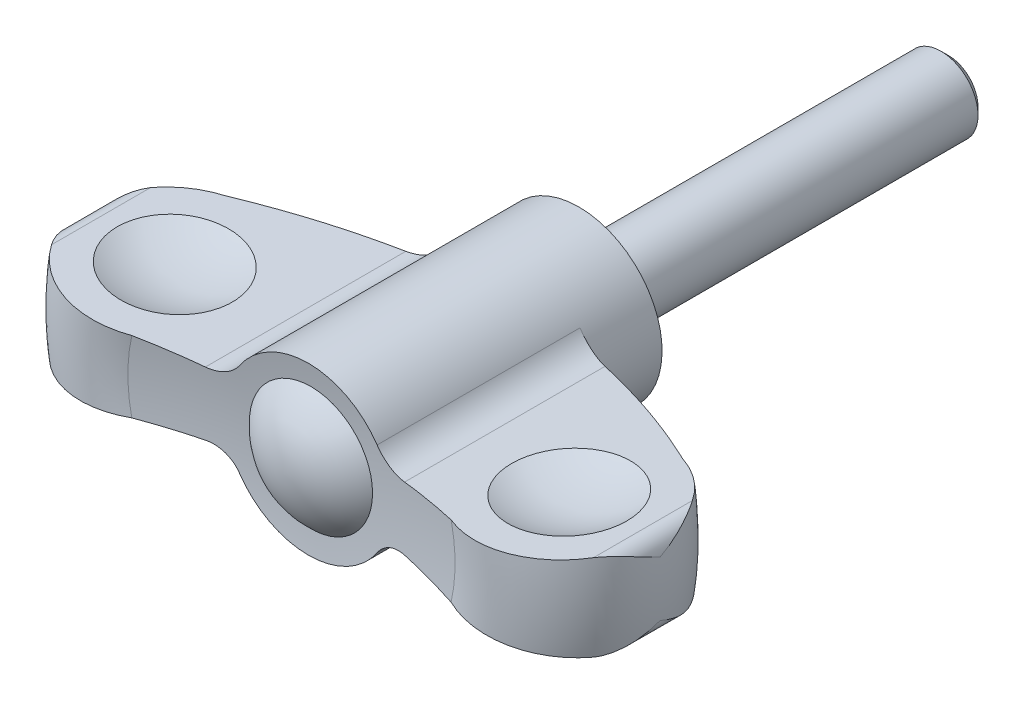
ISO-10303-21;
HEADER;
FILE_DESCRIPTION(('STEP AP214'),'2;1');
FILE_NAME('part.step','',(''),(''),'','','');
FILE_SCHEMA(('AUTOMOTIVE_DESIGN { 1 0 10303 214 1 1 1 1 }'));
ENDSEC;
DATA;
#1=APPLICATION_CONTEXT('core data for automotive mechanical design processes');
#2=APPLICATION_PROTOCOL_DEFINITION('international standard','automotive_design',2000,#1);
#3=PRODUCT_CONTEXT('',#1,'mechanical');
#4=PRODUCT('Part','Part','',(#3));
#5=PRODUCT_RELATED_PRODUCT_CATEGORY('part','',(#4));
#6=PRODUCT_DEFINITION_FORMATION('','',#4);
#7=PRODUCT_DEFINITION_CONTEXT('part definition',#1,'design');
#8=PRODUCT_DEFINITION('design','',#6,#7);
#9=PRODUCT_DEFINITION_SHAPE('','',#8);
#10=(LENGTH_UNIT() NAMED_UNIT(*) SI_UNIT(.MILLI.,.METRE.));
#11=(NAMED_UNIT(*) PLANE_ANGLE_UNIT() SI_UNIT($,.RADIAN.));
#12=(NAMED_UNIT(*) SI_UNIT($,.STERADIAN.) SOLID_ANGLE_UNIT());
#13=UNCERTAINTY_MEASURE_WITH_UNIT(LENGTH_MEASURE(1.E-05),#10,'distance_accuracy_value','');
#14=(GEOMETRIC_REPRESENTATION_CONTEXT(3) GLOBAL_UNCERTAINTY_ASSIGNED_CONTEXT((#13)) GLOBAL_UNIT_ASSIGNED_CONTEXT((#10,
#11,#12)) REPRESENTATION_CONTEXT('',''));
#15=CARTESIAN_POINT('',(0.,0.,0.));
#16=DIRECTION('',(0.,0.,1.));
#17=DIRECTION('',(1.,0.,0.));
#18=AXIS2_PLACEMENT_3D('',#15,#16,#17);
#19=CARTESIAN_POINT('',(0.,0.,60.8916836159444));
#20=DIRECTION('',(0.,0.,1.));
#21=DIRECTION('',(0.,1.,0.));
#22=AXIS2_PLACEMENT_3D('',#19,#20,#21);
#23=DEGENERATE_TOROIDAL_SURFACE('',#22,7.24809636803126,57.1330492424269,.F.);
#24=CARTESIAN_POINT('',(0.,0.,5.5));
#25=DIRECTION('',(0.,0.,1.));
#26=DIRECTION('',(0.,1.,0.));
#27=AXIS2_PLACEMENT_3D('',#24,#25,#26);
#28=CIRCLE('',#27,6.75);
#29=CARTESIAN_POINT('',(5.58468393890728,-3.79128016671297,5.5));
#30=VERTEX_POINT('',#29);
#31=CARTESIAN_POINT('',(5.58468393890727,3.79128016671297,5.5));
#32=VERTEX_POINT('',#31);
#33=EDGE_CURVE('E157',#30,#32,#28,.T.);
#34=ORIENTED_EDGE('',*,*,#33,.T.);
#35=CARTESIAN_POINT('',(5.58454817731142,3.79148016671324,5.5000000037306));
#36=CARTESIAN_POINT('',(5.6270350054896,3.72886637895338,5.49999203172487));
#37=CARTESIAN_POINT('',(5.67207292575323,3.66799067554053,5.50109190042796));
#38=CARTESIAN_POINT('',(5.76687239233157,3.55013742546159,5.50546469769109));
#39=CARTESIAN_POINT('',(5.81663303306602,3.49315913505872,5.5087372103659));
#40=CARTESIAN_POINT('',(5.92037232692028,3.3836500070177,5.51740071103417));
#41=CARTESIAN_POINT('',(5.97433893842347,3.33110730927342,5.5227858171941));
#42=CARTESIAN_POINT('',(6.08617319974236,3.23065312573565,5.53558959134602));
#43=CARTESIAN_POINT('',(6.14404090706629,3.1827417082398,5.54300828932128));
#44=CARTESIAN_POINT('',(6.32281948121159,3.04645743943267,5.56816484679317));
#45=CARTESIAN_POINT('',(6.44903201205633,2.9654018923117,5.58881397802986));
#46=CARTESIAN_POINT('',(6.71175482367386,2.82481579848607,5.63683026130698));
#47=CARTESIAN_POINT('',(6.84827321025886,2.76530241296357,5.66420274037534));
#48=CARTESIAN_POINT('',(7.13180529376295,2.66747892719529,5.72532830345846));
#49=CARTESIAN_POINT('',(7.27900617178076,2.62981214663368,5.75923917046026));
#50=CARTESIAN_POINT('',(7.57631968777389,2.57880440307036,5.83159976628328));
#51=CARTESIAN_POINT('',(7.72642802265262,2.56542990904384,5.87004316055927));
#52=CARTESIAN_POINT('',(7.91146899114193,2.56375196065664,5.91959867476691));
#53=CARTESIAN_POINT('',(7.94691227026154,2.56410633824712,5.92918950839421));
#54=CARTESIAN_POINT('',(8.01766035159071,2.56615563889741,5.94852854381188));
#55=CARTESIAN_POINT('',(8.05296528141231,2.56784856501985,5.958276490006));
#56=CARTESIAN_POINT('',(8.08821506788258,2.57020553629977,5.96810530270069));
#57=B_SPLINE_CURVE_WITH_KNOTS('',3,(#35,#36,#37,#38,#39,#40,#41,#42,#43,#44,#45,#46,#47,#48,#49,
#50,#51,#52,#53,#54,#55,#56),.UNSPECIFIED.,.F.,.F.,(4,2,2,2,2,2,2,2,2,2,4),(0.,
0.226923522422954,0.453803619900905,0.680056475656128,0.906312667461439,1.35828167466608,
1.81060994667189,2.27565813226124,2.74006391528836,2.85020967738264,2.96019142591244),.UNSPECIFIED.);
#58=CARTESIAN_POINT('',(8.08801506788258,2.57019216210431,5.96804953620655));
#59=VERTEX_POINT('',#58);
#60=EDGE_CURVE('E251',#32,#59,#57,.T.);
#61=ORIENTED_EDGE('',*,*,#60,.T.);
#62=CARTESIAN_POINT('',(18.5568278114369,3.2698755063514,10.0639861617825));
#63=CARTESIAN_POINT('',(17.7202118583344,3.21396025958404,9.63606709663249));
#64=CARTESIAN_POINT('',(16.8730027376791,3.15733701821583,9.22898268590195));
#65=CARTESIAN_POINT('',(15.1615683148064,3.04295325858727,8.45851890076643));
#66=CARTESIAN_POINT('',(14.2973907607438,2.98519593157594,8.09503297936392));
#67=CARTESIAN_POINT('',(12.5519653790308,2.86854038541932,7.41164455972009));
#68=CARTESIAN_POINT('',(11.6707170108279,2.80964213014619,7.09174344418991));
#69=CARTESIAN_POINT('',(10.3366076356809,2.72047689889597,6.64515483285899));
#70=CARTESIAN_POINT('',(9.88928279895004,2.6905799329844,6.5016730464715));
#71=CARTESIAN_POINT('',(8.99112522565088,2.63055155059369,6.22618011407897));
#72=CARTESIAN_POINT('',(8.54029244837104,2.6004201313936,6.0941691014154));
#73=CARTESIAN_POINT('',(8.08781506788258,2.57017879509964,5.96799377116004));
#74=B_SPLINE_CURVE_WITH_KNOTS('',3,(#62,#63,#64,#65,#66,#67,#68,#69,#70,#71,#72,#73),
.UNSPECIFIED.,.F.,.F.,(4,2,2,2,2,4),(0.,2.82377208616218,5.64049635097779,8.45730995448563,
9.86934742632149,11.2814013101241),.UNSPECIFIED.);
#75=CARTESIAN_POINT('',(18.5564367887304,3.26984937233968,10.0637861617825));
#76=VERTEX_POINT('',#75);
#77=EDGE_CURVE('E242',#76,#59,#74,.T.);
#78=ORIENTED_EDGE('',*,*,#77,.F.);
#79=CARTESIAN_POINT('',(0.,0.,10.0637861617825));
#80=DIRECTION('',(0.,0.,1.));
#81=DIRECTION('',(0.,1.,0.));
#82=AXIS2_PLACEMENT_3D('',#79,#80,#81);
#83=CIRCLE('',#82,18.8423263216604);
#84=CARTESIAN_POINT('',(18.5564367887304,-3.26984937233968,10.0637861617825));
#85=VERTEX_POINT('',#84);
#86=EDGE_CURVE('E402',#85,#76,#83,.T.);
#87=ORIENTED_EDGE('',*,*,#86,.F.);
#88=CARTESIAN_POINT('',(8.08781506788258,-2.57017879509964,5.96799377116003));
#89=CARTESIAN_POINT('',(8.43648524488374,-2.59348217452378,6.06521586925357));
#90=CARTESIAN_POINT('',(8.78418982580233,-2.6167210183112,6.16591362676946));
#91=CARTESIAN_POINT('',(9.47752423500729,-2.66306003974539,6.37414417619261));
#92=CARTESIAN_POINT('',(9.82315423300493,-2.68616022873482,6.48167640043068));
#93=CARTESIAN_POINT('',(10.8568675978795,-2.7552484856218,6.81439605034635));
#94=CARTESIAN_POINT('',(11.5417095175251,-2.80101991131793,7.04968835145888));
#95=CARTESIAN_POINT('',(13.5766416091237,-2.93702464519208,7.79319141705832));
#96=CARTESIAN_POINT('',(14.9128146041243,-3.02632779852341,8.34061833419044));
#97=CARTESIAN_POINT('',(16.6182429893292,-3.14031014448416,9.11672807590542));
#98=CARTESIAN_POINT('',(17.0086949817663,-3.16640601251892,9.29983650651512));
#99=CARTESIAN_POINT('',(17.785774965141,-3.21834217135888,9.67514693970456));
#100=CARTESIAN_POINT('',(18.1723980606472,-3.24418213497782,9.86735912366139));
#101=CARTESIAN_POINT('',(18.5568278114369,-3.2698755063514,10.0639861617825));
#102=B_SPLINE_CURVE_WITH_KNOTS('',3,(#88,#89,#90,#91,#92,#93,#94,#95,#96,#97,#98,#99,#100,#101),
.UNSPECIFIED.,.F.,.F.,(4,2,2,2,2,2,4),(0.,1.0881425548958,2.17619484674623,4.35250158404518,
8.68743833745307,9.98350841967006,11.2810638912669),.UNSPECIFIED.);
#103=CARTESIAN_POINT('',(8.08801506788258,-2.57019216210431,5.96804953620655));
#104=VERTEX_POINT('',#103);
#105=EDGE_CURVE('E232',#104,#85,#102,.T.);
#106=ORIENTED_EDGE('',*,*,#105,.F.);
#107=CARTESIAN_POINT('',(8.08821506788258,-2.57020553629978,5.96810530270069));
#108=CARTESIAN_POINT('',(8.00997344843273,-2.56497338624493,5.94629000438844));
#109=CARTESIAN_POINT('',(7.9314394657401,-2.5630200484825,5.92486614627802));
#110=CARTESIAN_POINT('',(7.77422277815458,-2.56573749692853,5.88295181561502));
#111=CARTESIAN_POINT('',(7.69554004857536,-2.57040950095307,5.862461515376));
#112=CARTESIAN_POINT('',(7.45993217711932,-2.59446790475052,5.80261995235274));
#113=CARTESIAN_POINT('',(7.30348188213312,-2.62389903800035,5.7649076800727));
#114=CARTESIAN_POINT('',(6.99637317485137,-2.7094115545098,5.69535012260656));
#115=CARTESIAN_POINT('',(6.84572761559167,-2.76554877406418,5.66351732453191));
#116=CARTESIAN_POINT('',(6.55526150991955,-2.90348395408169,5.60733410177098));
#117=CARTESIAN_POINT('',(6.4154250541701,-2.98524327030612,5.58297251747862));
#118=CARTESIAN_POINT('',(6.21564820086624,-3.12665619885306,5.55280138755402));
#119=CARTESIAN_POINT('',(6.14994832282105,-3.17769981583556,5.54373343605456));
#120=CARTESIAN_POINT('',(6.0231628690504,-3.28560819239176,5.52805647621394));
#121=CARTESIAN_POINT('',(5.96207731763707,-3.34247298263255,5.5214474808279));
#122=CARTESIAN_POINT('',(5.84481263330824,-3.46187538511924,5.51078652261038));
#123=CARTESIAN_POINT('',(5.78866161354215,-3.52444182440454,5.50674848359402));
#124=CARTESIAN_POINT('',(5.68213708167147,-3.65444758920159,5.50134928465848));
#125=CARTESIAN_POINT('',(5.63176510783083,-3.72188820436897,5.49998883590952));
#126=CARTESIAN_POINT('',(5.58454817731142,-3.79148016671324,5.50000000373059));
#127=B_SPLINE_CURVE_WITH_KNOTS('',3,(#107,#108,#109,#110,#111,#112,#113,#114,#115,#116,#117,
#118,#119,#120,#121,#122,#123,#124,#125,#126),.UNSPECIFIED.,.F.,.F.,(4,2,2,2,2,2,2,2,2,4),(0.,
0.244043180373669,0.488131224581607,0.976413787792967,1.46572175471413,1.95429525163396,
2.20506346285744,2.4558329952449,2.70794934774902,2.96013265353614),.UNSPECIFIED.);
#128=EDGE_CURVE('E222',#104,#30,#127,.T.);
#129=ORIENTED_EDGE('',*,*,#128,.T.);
#130=EDGE_LOOP('',(#34,#61,#78,#87,#106,#129));
#131=FACE_BOUND('',#130,.T.);
#132=ADVANCED_FACE('F14',(#131),#23,.F.);
#133=CARTESIAN_POINT('',(0.,0.,16.8));
#134=DIRECTION('',(0.,0.,1.));
#135=DIRECTION('',(0.,1.,0.));
#136=AXIS2_PLACEMENT_3D('',#133,#134,#135);
#137=TOROIDAL_SURFACE('',#136,16.3,7.2);
#138=CARTESIAN_POINT('',(-13.4430070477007,-2.92809317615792,10.0635861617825));
#139=CARTESIAN_POINT('',(-13.250045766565,-2.91519660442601,10.1357408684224));
#140=CARTESIAN_POINT('',(-13.0601324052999,-2.90250374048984,10.216071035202));
#141=CARTESIAN_POINT('',(-12.6877100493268,-2.8776128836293,10.3924240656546));
#142=CARTESIAN_POINT('',(-12.5052008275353,-2.86541487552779,10.4884464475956));
#143=CARTESIAN_POINT('',(-12.1489194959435,-2.84160280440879,10.6955091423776));
#144=CARTESIAN_POINT('',(-11.9751456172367,-2.8299886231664,10.8065463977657));
#145=CARTESIAN_POINT('',(-11.6375334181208,-2.8074243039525,11.042874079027));
#146=CARTESIAN_POINT('',(-11.47369496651,-2.79647415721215,11.1681643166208));
#147=CARTESIAN_POINT('',(-11.1570734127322,-2.77531274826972,11.4321870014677));
#148=CARTESIAN_POINT('',(-11.0042945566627,-2.76510176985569,11.5709245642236));
#149=CARTESIAN_POINT('',(-10.7109328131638,-2.74549493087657,11.8608983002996));
#150=CARTESIAN_POINT('',(-10.570354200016,-2.73609935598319,12.0121388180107));
#151=CARTESIAN_POINT('',(-10.3025713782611,-2.7182020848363,12.3259661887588));
#152=CARTESIAN_POINT('',(-10.1753613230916,-2.70969999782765,12.4885480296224));
#153=CARTESIAN_POINT('',(-9.93523518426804,-2.69365116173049,12.8239887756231));
#154=CARTESIAN_POINT('',(-9.82231883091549,-2.68610439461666,12.9968474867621));
#155=CARTESIAN_POINT('',(-9.61240942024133,-2.67207509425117,13.3504168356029));
#156=CARTESIAN_POINT('',(-9.51531257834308,-2.6655856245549,13.5310655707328));
#157=CARTESIAN_POINT('',(-9.33694719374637,-2.6536645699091,13.8999735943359));
#158=CARTESIAN_POINT('',(-9.2556730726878,-2.64823261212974,14.0882301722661));
#159=CARTESIAN_POINT('',(-9.10959731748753,-2.63846963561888,14.4711021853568));
#160=CARTESIAN_POINT('',(-9.0447989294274,-2.63413883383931,14.6657188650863));
#161=CARTESIAN_POINT('',(-8.93227844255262,-2.62661852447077,15.0598492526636));
#162=CARTESIAN_POINT('',(-8.88455601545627,-2.62342899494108,15.2593628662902));
#163=CARTESIAN_POINT('',(-8.80746852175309,-2.61827685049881,15.6574650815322));
#164=CARTESIAN_POINT('',(-8.77773054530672,-2.6162893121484,15.8559812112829));
#165=CARTESIAN_POINT('',(-8.73529826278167,-2.6134533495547,16.2548338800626));
#166=CARTESIAN_POINT('',(-8.7226036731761,-2.61260490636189,16.4551703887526));
#167=CARTESIAN_POINT('',(-8.71437606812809,-2.61205501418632,16.8561671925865));
#168=CARTESIAN_POINT('',(-8.71884052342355,-2.61235339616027,17.0568274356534));
#169=CARTESIAN_POINT('',(-8.74488386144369,-2.61409400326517,17.4570282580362));
#170=CARTESIAN_POINT('',(-8.76646264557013,-2.6155362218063,17.6565688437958));
#171=CARTESIAN_POINT('',(-8.82608238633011,-2.6195209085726,18.0500864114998));
#172=CARTESIAN_POINT('',(-8.86387061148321,-2.62204648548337,18.2441019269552));
#173=CARTESIAN_POINT('',(-8.95554073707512,-2.62817326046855,18.6283441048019));
#174=CARTESIAN_POINT('',(-9.00942811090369,-2.63177482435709,18.8185694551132));
#175=CARTESIAN_POINT('',(-9.13281555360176,-2.64002142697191,19.1937999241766));
#176=CARTESIAN_POINT('',(-9.20231107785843,-2.64466616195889,19.3788065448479));
#177=CARTESIAN_POINT('',(-9.35638258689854,-2.6549635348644,19.742479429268));
#178=CARTESIAN_POINT('',(-9.44096421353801,-2.66061654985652,19.9211432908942));
#179=CARTESIAN_POINT('',(-9.62545322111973,-2.67294687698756,20.2726485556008));
#180=CARTESIAN_POINT('',(-9.72550696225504,-2.6796339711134,20.4454127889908));
#181=CARTESIAN_POINT('',(-9.93957002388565,-2.69394088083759,20.7821124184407));
#182=CARTESIAN_POINT('',(-10.0535844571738,-2.70156103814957,20.9460445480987));
#183=CARTESIAN_POINT('',(-10.2946584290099,-2.71767322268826,21.263898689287));
#184=CARTESIAN_POINT('',(-10.4217143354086,-2.7261650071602,21.4178234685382));
#185=CARTESIAN_POINT('',(-10.688029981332,-2.74396421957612,21.7147703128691));
#186=CARTESIAN_POINT('',(-10.8272940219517,-2.75327193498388,21.8577885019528));
#187=CARTESIAN_POINT('',(-11.1201972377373,-2.77284812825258,22.1349543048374));
#188=CARTESIAN_POINT('',(-11.2740848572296,-2.78313321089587,22.2688382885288));
#189=CARTESIAN_POINT('',(-11.5924511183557,-2.80441122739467,22.5232972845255));
#190=CARTESIAN_POINT('',(-11.7569299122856,-2.81540417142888,22.6438721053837));
#191=CARTESIAN_POINT('',(-12.0953583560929,-2.83802304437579,22.8709220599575));
#192=CARTESIAN_POINT('',(-12.2693100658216,-2.84964911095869,22.9773941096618));
#193=CARTESIAN_POINT('',(-12.6253835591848,-2.87344729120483,23.175449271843));
#194=CARTESIAN_POINT('',(-12.8075027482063,-2.88561923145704,23.2670370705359));
#195=CARTESIAN_POINT('',(-13.1810420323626,-2.9105847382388,23.4357878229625));
#196=CARTESIAN_POINT('',(-13.37255033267,-2.92338419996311,23.5127547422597));
#197=CARTESIAN_POINT('',(-13.7613485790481,-2.94936953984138,23.6502587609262));
#198=CARTESIAN_POINT('',(-13.9586384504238,-2.96255541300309,23.7107960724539));
#199=CARTESIAN_POINT('',(-14.3576152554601,-2.98922103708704,23.8149976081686));
#200=CARTESIAN_POINT('',(-14.5593023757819,-3.00270080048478,23.8586611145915));
#201=CARTESIAN_POINT('',(-14.9656299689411,-3.02985771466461,23.9287762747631));
#202=CARTESIAN_POINT('',(-15.170270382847,-3.04353486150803,23.9552282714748));
#203=CARTESIAN_POINT('',(-15.5810553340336,-3.07098968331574,23.9907056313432));
#204=CARTESIAN_POINT('',(-15.7871999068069,-3.08476736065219,23.9997305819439));
#205=CARTESIAN_POINT('',(-16.1994347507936,-3.11231908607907,24.000257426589));
#206=CARTESIAN_POINT('',(-16.4055250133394,-3.1260931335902,23.9917658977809));
#207=CARTESIAN_POINT('',(-16.816299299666,-3.15354724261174,23.9572980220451));
#208=CARTESIAN_POINT('',(-17.0209829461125,-3.16722727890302,23.9313171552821));
#209=CARTESIAN_POINT('',(-17.4273317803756,-3.19438561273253,23.8620348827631));
#210=CARTESIAN_POINT('',(-17.6289980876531,-3.20786398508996,23.8187400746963));
#211=CARTESIAN_POINT('',(-18.0267250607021,-3.23444607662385,23.7154246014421));
#212=CARTESIAN_POINT('',(-18.2228121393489,-3.24755156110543,23.6555060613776));
#213=CARTESIAN_POINT('',(-18.6091495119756,-3.27337242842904,23.5192613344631));
#214=CARTESIAN_POINT('',(-18.7994018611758,-3.28608794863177,23.4429410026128));
#215=CARTESIAN_POINT('',(-19.1728922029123,-3.31105018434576,23.2743446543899));
#216=CARTESIAN_POINT('',(-19.3561252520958,-3.32329656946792,23.1820576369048));
#217=CARTESIAN_POINT('',(-19.7140940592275,-3.34722142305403,22.9822113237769));
#218=CARTESIAN_POINT('',(-19.8888301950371,-3.35889991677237,22.8746527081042));
#219=CARTESIAN_POINT('',(-20.2275235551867,-3.38153649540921,22.6457025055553));
#220=CARTESIAN_POINT('',(-20.3915386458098,-3.39249844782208,22.5243968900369));
#221=CARTESIAN_POINT('',(-20.7087215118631,-3.41369737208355,22.2682963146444));
#222=CARTESIAN_POINT('',(-20.8618896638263,-3.42393436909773,22.133501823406));
#223=CARTESIAN_POINT('',(-21.1559703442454,-3.44358925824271,21.851664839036));
#224=CARTESIAN_POINT('',(-21.296906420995,-3.45300872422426,21.704646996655));
#225=CARTESIAN_POINT('',(-21.565777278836,-3.47097871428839,21.3992346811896));
#226=CARTESIAN_POINT('',(-21.6937203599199,-3.47952979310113,21.240847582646));
#227=CARTESIAN_POINT('',(-21.8466005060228,-3.48974754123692,21.0342564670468));
#228=CARTESIAN_POINT('',(-21.8780226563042,-3.49184764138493,20.9907857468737));
#229=CARTESIAN_POINT('',(-21.9398602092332,-3.49598055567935,20.9031903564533));
#230=CARTESIAN_POINT('',(-21.9702765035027,-3.49801342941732,20.8590663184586));
#231=CARTESIAN_POINT('',(-22.0002000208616,-3.50001336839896,20.8146028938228));
#232=B_SPLINE_CURVE_WITH_KNOTS('',3,(#138,#139,#140,#141,#142,#143,#144,#145,#146,#147,#148,
#149,#150,#151,#152,#153,#154,#155,#156,#157,#158,#159,#160,#161,#162,#163,#164,#165,#166,#167,
#168,#169,#170,#171,#172,#173,#174,#175,#176,#177,#178,#179,#180,#181,#182,#183,#184,#185,#186,
#187,#188,#189,#190,#191,#192,#193,#194,#195,#196,#197,#198,#199,#200,#201,#202,#203,#204,#205,
#206,#207,#208,#209,#210,#211,#212,#213,#214,#215,#216,#217,#218,#219,#220,#221,#222,#223,#224,
#225,#226,#227,#228,#229,#230,#231),.UNSPECIFIED.,.F.,.F.,(4,2,2,2,2,2,2,2,2,2,2,2,2,2,2,2,2,2,
2,2,2,2,2,2,2,2,2,2,2,2,2,2,2,2,2,2,2,2,2,2,2,2,2,2,2,2,4),(0.,0.619053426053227,
1.23808785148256,1.85699641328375,2.47589680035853,3.09503355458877,3.71438635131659,
4.33346714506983,4.95253625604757,5.56736438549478,6.18197536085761,6.79670733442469,
7.41142748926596,8.01292036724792,8.61440323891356,9.21579745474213,9.81718820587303,
10.4095249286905,11.0020632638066,11.5944292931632,12.1870173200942,12.7855991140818,
13.3844007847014,13.9830361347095,14.5818832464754,15.1938756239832,15.8058768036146,
16.4180115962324,17.029953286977,17.6495959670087,18.2692306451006,18.8888916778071,
19.5085403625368,20.1282037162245,20.7476344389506,21.3672253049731,21.9865802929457,
22.6022115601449,23.217623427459,23.8334610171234,24.4492711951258,25.0614231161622,
25.6735537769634,26.2844785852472,26.8950106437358,27.0560402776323,27.216923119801),.UNSPECIFIED.);
#233=CARTESIAN_POINT('',(-12.9627653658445,-2.89599621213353,23.3370956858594));
#234=VERTEX_POINT('',#233);
#235=CARTESIAN_POINT('',(-22.0000000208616,-3.5,20.8149000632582));
#236=VERTEX_POINT('',#235);
#237=EDGE_CURVE('E276',#234,#236,#232,.T.);
#238=ORIENTED_EDGE('',*,*,#237,.F.);
#239=CARTESIAN_POINT('',(0.,0.,23.3370956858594));
#240=DIRECTION('',(0.,0.,1.));
#241=DIRECTION('',(0.,1.,0.));
#242=AXIS2_PLACEMENT_3D('',#239,#240,#241);
#243=CIRCLE('',#242,13.2823220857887);
#244=CARTESIAN_POINT('',(-12.9627653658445,2.89599621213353,23.3370956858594));
#245=VERTEX_POINT('',#244);
#246=EDGE_CURVE('E210',#245,#234,#243,.T.);
#247=ORIENTED_EDGE('',*,*,#246,.F.);
#248=CARTESIAN_POINT('',(-22.0002,3.50001336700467,20.8146029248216));
#249=CARTESIAN_POINT('',(-21.8869659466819,3.49244536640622,20.9829001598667));
#250=CARTESIAN_POINT('',(-21.7665908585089,3.48440009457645,21.1463645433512));
#251=CARTESIAN_POINT('',(-21.5125154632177,3.46741895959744,21.4625195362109));
#252=CARTESIAN_POINT('',(-21.378816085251,3.45848315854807,21.6152108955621));
#253=CARTESIAN_POINT('',(-21.0991608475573,3.43979239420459,21.9086013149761));
#254=CARTESIAN_POINT('',(-20.9532163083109,3.43003818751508,22.0493112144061));
#255=CARTESIAN_POINT('',(-20.6500231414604,3.4097742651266,22.3179109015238));
#256=CARTESIAN_POINT('',(-20.4927745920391,3.399264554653,22.445800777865));
#257=CARTESIAN_POINT('',(-20.1680719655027,3.377563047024,22.6878898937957));
#258=CARTESIAN_POINT('',(-20.0006161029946,3.36637113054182,22.8020867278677));
#259=CARTESIAN_POINT('',(-19.6566594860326,3.34338278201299,23.0160136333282));
#260=CARTESIAN_POINT('',(-19.4801554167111,3.33158612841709,23.1157383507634));
#261=CARTESIAN_POINT('',(-19.1195107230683,3.3074824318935,23.299940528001));
#262=CARTESIAN_POINT('',(-18.9353740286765,3.29517565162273,23.3844257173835));
#263=CARTESIAN_POINT('',(-18.5606181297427,3.27012883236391,23.5376689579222));
#264=CARTESIAN_POINT('',(-18.369996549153,3.25738863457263,23.6064211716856));
#265=CARTESIAN_POINT('',(-17.9830362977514,3.23152613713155,23.7279050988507));
#266=CARTESIAN_POINT('',(-17.7866806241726,3.21840270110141,23.780582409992));
#267=CARTESIAN_POINT('',(-17.3901835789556,3.19190281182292,23.8692781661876));
#268=CARTESIAN_POINT('',(-17.1900408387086,3.17852626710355,23.9052904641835));
#269=CARTESIAN_POINT('',(-16.7874574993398,3.15161960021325,23.9604036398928));
#270=CARTESIAN_POINT('',(-16.5850169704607,3.13808948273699,23.9795050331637));
#271=CARTESIAN_POINT('',(-16.1792478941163,3.11096989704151,24.0006952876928));
#272=CARTESIAN_POINT('',(-15.9759193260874,3.09738042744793,24.0027837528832));
#273=CARTESIAN_POINT('',(-15.5684666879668,3.07014832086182,23.9899203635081));
#274=CARTESIAN_POINT('',(-15.364346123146,3.05650591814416,23.9748568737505));
#275=CARTESIAN_POINT('',(-14.9580777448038,3.02935296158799,23.9276425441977));
#276=CARTESIAN_POINT('',(-14.755929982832,3.01584241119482,23.8954912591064));
#277=CARTESIAN_POINT('',(-14.3550670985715,2.98905073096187,23.814360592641));
#278=CARTESIAN_POINT('',(-14.1563513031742,2.97576955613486,23.7653845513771));
#279=CARTESIAN_POINT('',(-13.7636331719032,2.94952223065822,23.6509482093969));
#280=CARTESIAN_POINT('',(-13.5696323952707,2.9365561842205,23.5854825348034));
#281=CARTESIAN_POINT('',(-13.1865164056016,2.91095061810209,23.4380671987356));
#282=CARTESIAN_POINT('',(-12.9974412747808,2.89831377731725,23.356012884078));
#283=CARTESIAN_POINT('',(-12.6268363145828,2.87354438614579,23.1762764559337));
#284=CARTESIAN_POINT('',(-12.4453065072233,2.86141183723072,23.078594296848));
#285=CARTESIAN_POINT('',(-12.0910342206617,2.83773404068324,22.8682633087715));
#286=CARTESIAN_POINT('',(-11.9182938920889,2.8261889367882,22.7556108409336));
#287=CARTESIAN_POINT('',(-11.5829402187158,2.80377556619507,22.516182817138));
#288=CARTESIAN_POINT('',(-11.4203233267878,2.79290706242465,22.3894122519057));
#289=CARTESIAN_POINT('',(-11.1059013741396,2.77189266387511,22.1222291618));
#290=CARTESIAN_POINT('',(-10.9541266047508,2.76174879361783,21.9817808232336));
#291=CARTESIAN_POINT('',(-10.6630509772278,2.74229474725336,21.6885550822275));
#292=CARTESIAN_POINT('',(-10.5237454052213,2.73298425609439,21.5357823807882));
#293=CARTESIAN_POINT('',(-10.2585504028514,2.71525994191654,21.2188580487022));
#294=CARTESIAN_POINT('',(-10.1326659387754,2.7068464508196,21.0547022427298));
#295=CARTESIAN_POINT('',(-9.89540453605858,2.69098907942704,20.7162706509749));
#296=CARTESIAN_POINT('',(-9.78402188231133,2.68354481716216,20.5419988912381));
#297=CARTESIAN_POINT('',(-9.57753567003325,2.66974430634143,20.1860989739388));
#298=CARTESIAN_POINT('',(-9.48229586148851,2.66337895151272,20.0045502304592));
#299=CARTESIAN_POINT('',(-9.30772151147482,2.65171127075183,19.6340070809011));
#300=CARTESIAN_POINT('',(-9.22838099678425,2.64640854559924,19.445015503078));
#301=CARTESIAN_POINT('',(-9.0862443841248,2.6369088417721,19.0608700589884));
#302=CARTESIAN_POINT('',(-9.02344908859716,2.63271191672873,18.8657158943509));
#303=CARTESIAN_POINT('',(-8.91497467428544,2.62546202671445,18.4706862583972));
#304=CARTESIAN_POINT('',(-8.86929523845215,2.62240904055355,18.2708108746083));
#305=CARTESIAN_POINT('',(-8.79627719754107,2.61752887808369,17.8722020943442));
#306=CARTESIAN_POINT('',(-8.76856256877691,2.61567657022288,17.6735378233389));
#307=CARTESIAN_POINT('',(-8.73017446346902,2.61311090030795,17.2745631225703));
#308=CARTESIAN_POINT('',(-8.71950071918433,2.61239752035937,17.0742527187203));
#309=CARTESIAN_POINT('',(-8.71529310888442,2.61211630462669,16.6734663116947));
#310=CARTESIAN_POINT('',(-8.72175798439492,2.61254838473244,16.4729903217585));
#311=CARTESIAN_POINT('',(-8.75176494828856,2.61455390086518,16.0733272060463));
#312=CARTESIAN_POINT('',(-8.77530694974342,2.61612733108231,15.8741400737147));
#313=CARTESIAN_POINT('',(-8.83878915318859,2.62037016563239,15.481363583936));
#314=CARTESIAN_POINT('',(-8.87848770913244,2.62302341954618,15.2877349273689));
#315=CARTESIAN_POINT('',(-8.97393104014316,2.62940237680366,14.9044232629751));
#316=CARTESIAN_POINT('',(-9.029681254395,2.6331284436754,14.7147416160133));
#317=CARTESIAN_POINT('',(-9.15673580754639,2.64162013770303,14.3407362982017));
#318=CARTESIAN_POINT('',(-9.2280365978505,2.64638552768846,14.1564114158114));
#319=CARTESIAN_POINT('',(-9.38562068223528,2.65691766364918,13.7943056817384));
#320=CARTESIAN_POINT('',(-9.47190458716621,2.66268445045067,13.6165250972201));
#321=CARTESIAN_POINT('',(-9.65980249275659,2.67524261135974,13.2667770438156));
#322=CARTESIAN_POINT('',(-9.76157423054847,2.68204452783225,13.094894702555));
#323=CARTESIAN_POINT('',(-9.97895442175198,2.69657313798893,12.7601587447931));
#324=CARTESIAN_POINT('',(-10.094562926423,2.70429983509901,12.5973051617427));
#325=CARTESIAN_POINT('',(-10.3388280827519,2.72062530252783,12.28159984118));
#326=CARTESIAN_POINT('',(-10.4674919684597,2.72922455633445,12.1287537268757));
#327=CARTESIAN_POINT('',(-10.7368892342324,2.74722972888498,11.8341521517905));
#328=CARTESIAN_POINT('',(-10.8776225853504,2.75663564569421,11.6923966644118));
#329=CARTESIAN_POINT('',(-11.1735584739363,2.77641452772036,11.4177499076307));
#330=CARTESIAN_POINT('',(-11.3290201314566,2.78680481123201,11.2851390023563));
#331=CARTESIAN_POINT('',(-11.6503816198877,2.80828301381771,11.0334204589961));
#332=CARTESIAN_POINT('',(-11.8162777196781,2.81937068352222,10.914308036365));
#333=CARTESIAN_POINT('',(-12.1571151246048,2.8421505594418,10.690516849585));
#334=CARTESIAN_POINT('',(-12.3320419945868,2.85384180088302,10.5858159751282));
#335=CARTESIAN_POINT('',(-12.6898958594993,2.87775897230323,10.3913862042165));
#336=CARTESIAN_POINT('',(-12.8728180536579,2.88998458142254,10.3016484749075));
#337=CARTESIAN_POINT('',(-13.1223586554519,2.90666263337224,10.1918600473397));
#338=CARTESIAN_POINT('',(-13.1860214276,2.9109175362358,10.1649193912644));
#339=CARTESIAN_POINT('',(-13.3140099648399,2.91947165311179,10.1128788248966));
#340=CARTESIAN_POINT('',(-13.3783349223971,2.92377081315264,10.0877769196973));
#341=CARTESIAN_POINT('',(-13.4430070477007,2.92809317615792,10.0635861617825));
#342=B_SPLINE_CURVE_WITH_KNOTS('',3,(#248,#249,#250,#251,#252,#253,#254,#255,#256,#257,#258,
#259,#260,#261,#262,#263,#264,#265,#266,#267,#268,#269,#270,#271,#272,#273,#274,#275,#276,#277,
#278,#279,#280,#281,#282,#283,#284,#285,#286,#287,#288,#289,#290,#291,#292,#293,#294,#295,#296,
#297,#298,#299,#300,#301,#302,#303,#304,#305,#306,#307,#308,#309,#310,#311,#312,#313,#314,#315,
#316,#317,#318,#319,#320,#321,#322,#323,#324,#325,#326,#327,#328,#329,#330,#331,#332,#333,#334,
#335,#336,#337,#338,#339,#340,#341),.UNSPECIFIED.,.F.,.F.,(4,2,2,2,2,2,2,2,2,2,2,2,2,2,2,2,2,2,
2,2,2,2,2,2,2,2,2,2,2,2,2,2,2,2,2,2,2,2,2,2,2,2,2,2,2,2,4),(0.,0.608767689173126,
1.21749295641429,1.82566153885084,2.43382591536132,3.04209697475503,3.65059249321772,
4.25877850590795,4.86718980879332,5.47763788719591,6.08831095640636,6.698965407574,
7.30963407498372,7.92430017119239,8.53898228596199,9.15354244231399,9.76830314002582,
10.387070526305,11.0058397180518,11.6247595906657,12.2434613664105,12.8638290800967,
13.4839612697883,14.1043221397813,14.7244377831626,15.3390262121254,15.9533833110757,
16.5677702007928,17.1821457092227,17.7832066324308,18.3842581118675,18.9852654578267,
19.5862697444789,20.1785973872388,20.7711259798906,21.3635195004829,21.9559371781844,
22.5548514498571,23.1537679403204,23.7530181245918,24.3522668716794,24.9653566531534,
25.5782284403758,26.1901492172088,26.8017074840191,27.0094652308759,27.2169941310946),.UNSPECIFIED.);
#343=CARTESIAN_POINT('',(-22.,3.5,20.8149000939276));
#344=VERTEX_POINT('',#343);
#345=EDGE_CURVE('E298',#344,#245,#342,.T.);
#346=ORIENTED_EDGE('',*,*,#345,.F.);
#347=CARTESIAN_POINT('',(-23.3936651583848,2.23303167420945,16.8));
#348=CARTESIAN_POINT('',(-23.3934426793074,2.23536251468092,16.8051493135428));
#349=CARTESIAN_POINT('',(-23.3932143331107,2.23769289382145,16.8102988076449));
#350=CARTESIAN_POINT('',(-23.3743145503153,2.42570445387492,17.2258528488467));
#351=CARTESIAN_POINT('',(-23.3183956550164,2.60830531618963,17.6373544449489));
#352=CARTESIAN_POINT('',(-23.1798743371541,2.85965877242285,18.2505518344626));
#353=CARTESIAN_POINT('',(-23.1245479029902,2.939723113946,18.4543861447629));
#354=CARTESIAN_POINT('',(-22.9956909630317,3.08909813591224,18.8603432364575));
#355=CARTESIAN_POINT('',(-22.9221687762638,3.1584137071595,19.0624667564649));
#356=CARTESIAN_POINT('',(-22.7850793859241,3.26116367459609,19.3959296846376));
#357=CARTESIAN_POINT('',(-22.7265638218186,3.29880232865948,19.5280746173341));
#358=CARTESIAN_POINT('',(-22.6018254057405,3.36602668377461,19.7906656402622));
#359=CARTESIAN_POINT('',(-22.5356088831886,3.39561893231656,19.9211130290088));
#360=CARTESIAN_POINT('',(-22.395316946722,3.44509635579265,20.180513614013));
#361=CARTESIAN_POINT('',(-22.3212053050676,3.46493421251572,20.3094566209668));
#362=CARTESIAN_POINT('',(-22.2046559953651,3.48552373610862,20.500765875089));
#363=CARTESIAN_POINT('',(-22.1648550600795,3.49085996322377,20.5642643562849));
#364=CARTESIAN_POINT('',(-22.0835651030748,3.49809816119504,20.6904076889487));
#365=CARTESIAN_POINT('',(-22.0420753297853,3.49999858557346,20.7530521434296));
#366=CARTESIAN_POINT('',(-21.9998,3.49999998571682,20.8151941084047));
#367=B_SPLINE_CURVE_WITH_KNOTS('',3,(#347,#348,#349,#350,#351,#352,#353,#354,#355,#356,#357,
#358,#359,#360,#361,#362,#363,#364,#365,#366),.UNSPECIFIED.,.F.,.F.,(4,2,2,2,2,2,2,2,2,4),(0.,
0.016970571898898,1.36944581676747,2.04642868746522,2.72310261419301,3.17077232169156,
3.61807665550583,4.06752995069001,4.29283181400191,4.51823506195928),.UNSPECIFIED.);
#368=CARTESIAN_POINT('',(-23.3936651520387,2.23303174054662,16.8));
#369=VERTEX_POINT('',#368);
#370=EDGE_CURVE('E360',#369,#344,#367,.T.);
#371=ORIENTED_EDGE('',*,*,#370,.F.);
#372=CARTESIAN_POINT('',(-21.9998,3.49999998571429,12.7848058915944));
#373=CARTESIAN_POINT('',(-22.0666741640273,3.49996244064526,12.8830879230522));
#374=CARTESIAN_POINT('',(-22.1315514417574,3.4952325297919,12.9826100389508));
#375=CARTESIAN_POINT('',(-22.2568815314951,3.47769367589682,13.1835115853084));
#376=CARTESIAN_POINT('',(-22.3173409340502,3.46489705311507,13.2848879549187));
#377=CARTESIAN_POINT('',(-22.4333648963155,3.43259083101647,13.4887461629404));
#378=CARTESIAN_POINT('',(-22.4889490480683,3.41310980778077,13.5912215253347));
#379=CARTESIAN_POINT('',(-22.5953729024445,3.3684102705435,13.7974289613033));
#380=CARTESIAN_POINT('',(-22.6462099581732,3.34318858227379,13.9011616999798));
#381=CARTESIAN_POINT('',(-22.774089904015,3.2701146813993,14.1765334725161));
#382=CARTESIAN_POINT('',(-22.8470051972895,3.21812877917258,14.3490158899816));
#383=CARTESIAN_POINT('',(-22.9794561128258,3.10414337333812,14.695745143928));
#384=CARTESIAN_POINT('',(-23.0389856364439,3.04213932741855,14.8699927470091));
#385=CARTESIAN_POINT('',(-23.1975205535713,2.84462859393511,15.3951794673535));
#386=CARTESIAN_POINT('',(-23.2763283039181,2.6977147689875,15.7482515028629));
#387=CARTESIAN_POINT('',(-23.3443046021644,2.49442989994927,16.2153989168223));
#388=CARTESIAN_POINT('',(-23.3580236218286,2.44419371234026,16.3292368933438));
#389=CARTESIAN_POINT('',(-23.3797700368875,2.34273549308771,16.5569077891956));
#390=CARTESIAN_POINT('',(-23.3878040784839,2.29151468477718,16.6707405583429));
#391=CARTESIAN_POINT('',(-23.3932143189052,2.23769296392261,16.7897010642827));
#392=CARTESIAN_POINT('',(-23.3934426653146,2.23536258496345,16.7948505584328));
#393=CARTESIAN_POINT('',(-23.3936651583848,2.23303167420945,16.8));
#394=B_SPLINE_CURVE_WITH_KNOTS('',3,(#372,#373,#374,#375,#376,#377,#378,#379,#380,#381,#382,
#383,#384,#385,#386,#387,#388,#389,#390,#391,#392,#393),.UNSPECIFIED.,.F.,.F.,(4,2,2,2,2,2,2,2,
2,2,4),(0.,0.356372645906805,0.712202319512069,1.06652937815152,1.42105283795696,
2.00316709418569,2.58554603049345,3.75135617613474,4.12686584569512,4.5019357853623,
4.51890635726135),.UNSPECIFIED.);
#395=CARTESIAN_POINT('',(-22.,3.5,12.7850999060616));
#396=VERTEX_POINT('',#395);
#397=EDGE_CURVE('E354',#396,#369,#394,.T.);
#398=ORIENTED_EDGE('',*,*,#397,.F.);
#399=CARTESIAN_POINT('',(-18.5559048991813,3.26981382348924,10.0635861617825));
#400=CARTESIAN_POINT('',(-18.7481532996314,3.28266274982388,10.1358408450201));
#401=CARTESIAN_POINT('',(-18.9373210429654,3.29530578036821,10.2163336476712));
#402=CARTESIAN_POINT('',(-19.308161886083,3.32009093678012,10.3931469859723));
#403=CARTESIAN_POINT('',(-19.4898343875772,3.332233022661,10.4894687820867));
#404=CARTESIAN_POINT('',(-19.8398224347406,3.35562448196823,10.6946430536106));
#405=CARTESIAN_POINT('',(-20.0083599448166,3.36688869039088,10.8031155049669));
#406=CARTESIAN_POINT('',(-20.3358278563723,3.38877501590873,11.0337190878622));
#407=CARTESIAN_POINT('',(-20.4947599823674,3.39939724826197,11.1558477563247));
#408=CARTESIAN_POINT('',(-20.7764213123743,3.41822208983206,11.3915935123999));
#409=CARTESIAN_POINT('',(-20.9007819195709,3.42653373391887,11.5032605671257));
#410=CARTESIAN_POINT('',(-21.141456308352,3.44261921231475,11.7349898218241));
#411=CARTESIAN_POINT('',(-21.2577703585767,3.45039306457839,11.8550517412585));
#412=CARTESIAN_POINT('',(-21.4842055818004,3.46552686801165,12.105686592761));
#413=CARTESIAN_POINT('',(-21.5941379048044,3.47287419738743,12.2364309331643));
#414=CARTESIAN_POINT('',(-21.8044661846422,3.48693149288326,12.5054420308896));
#415=CARTESIAN_POINT('',(-21.9048606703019,3.49364136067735,12.6437099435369));
#416=CARTESIAN_POINT('',(-22.0002,3.50001336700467,12.7853970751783));
#417=B_SPLINE_CURVE_WITH_KNOTS('',3,(#399,#400,#401,#402,#403,#404,#405,#406,#407,#408,#409,
#410,#411,#412,#413,#414,#415,#416),.UNSPECIFIED.,.F.,.F.,(4,2,2,2,2,2,2,2,4),(0.,
0.617158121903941,1.23436541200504,1.83590974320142,2.43734575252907,2.93898887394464,
3.44061523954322,3.95311321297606,4.46569010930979),.UNSPECIFIED.);
#418=CARTESIAN_POINT('',(-18.5564367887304,3.26984937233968,10.0637861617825));
#419=VERTEX_POINT('',#418);
#420=EDGE_CURVE('E277',#419,#396,#417,.T.);
#421=ORIENTED_EDGE('',*,*,#420,.F.);
#422=CARTESIAN_POINT('',(-18.5564367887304,-3.26984937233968,10.0637861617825));
#423=VERTEX_POINT('',#422);
#424=EDGE_CURVE('E399',#419,#423,#83,.T.);
#425=ORIENTED_EDGE('',*,*,#424,.T.);
#426=CARTESIAN_POINT('',(-22.0002000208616,-3.50001336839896,12.7853971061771));
#427=CARTESIAN_POINT('',(-21.8855721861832,-3.49235221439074,12.6150255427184));
#428=CARTESIAN_POINT('',(-21.7636225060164,-3.48420170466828,12.4496052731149));
#429=CARTESIAN_POINT('',(-21.5060663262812,-3.46698793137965,12.1298039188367));
#430=CARTESIAN_POINT('',(-21.3704594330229,-3.45792464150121,11.9754231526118));
#431=CARTESIAN_POINT('',(-21.0901761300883,-3.43919190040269,11.6826018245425));
#432=CARTESIAN_POINT('',(-20.9458162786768,-3.42954360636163,11.5438566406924));
#433=CARTESIAN_POINT('',(-20.6460984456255,-3.4095119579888,11.2788991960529));
#434=CARTESIAN_POINT('',(-20.4907422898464,-3.39912872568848,11.1526848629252));
#435=CARTESIAN_POINT('',(-20.1963110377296,-3.3794504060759,10.9331636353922));
#436=CARTESIAN_POINT('',(-20.058720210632,-3.37025451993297,10.8378487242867));
#437=CARTESIAN_POINT('',(-19.7772660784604,-3.35144352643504,10.6570247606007));
#438=CARTESIAN_POINT('',(-19.6334029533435,-3.34182843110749,10.571515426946));
#439=CARTESIAN_POINT('',(-19.3369202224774,-3.32201300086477,10.4089623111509));
#440=CARTESIAN_POINT('',(-19.1841783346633,-3.31180449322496,10.3321425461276));
#441=CARTESIAN_POINT('',(-18.8736362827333,-3.29104940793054,10.1895126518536));
#442=CARTESIAN_POINT('',(-18.7158354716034,-3.28050278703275,10.123703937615));
#443=CARTESIAN_POINT('',(-18.5559048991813,-3.26981382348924,10.0635861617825));
#444=B_SPLINE_CURVE_WITH_KNOTS('',3,(#426,#427,#428,#429,#430,#431,#432,#433,#434,#435,#436,
#437,#438,#439,#440,#441,#442,#443),.UNSPECIFIED.,.F.,.F.,(4,2,2,2,2,2,2,2,4),(0.,
0.616269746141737,1.23255726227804,1.83324114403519,2.43382551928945,2.93633271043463,
3.43882549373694,3.95222439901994,4.46568922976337),.UNSPECIFIED.);
#445=CARTESIAN_POINT('',(-22.0000000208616,-3.5,12.7850999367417));
#446=VERTEX_POINT('',#445);
#447=EDGE_CURVE('E530',#446,#423,#444,.T.);
#448=ORIENTED_EDGE('',*,*,#447,.F.);
#449=CARTESIAN_POINT('',(-23.3936651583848,-2.23303167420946,16.8));
#450=CARTESIAN_POINT('',(-23.3934426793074,-2.23536251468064,16.794850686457));
#451=CARTESIAN_POINT('',(-23.3932143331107,-2.23769289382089,16.7897011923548));
#452=CARTESIAN_POINT('',(-23.3743145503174,-2.42570445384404,16.374147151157));
#453=CARTESIAN_POINT('',(-23.3183956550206,-2.60830531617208,15.9626455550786));
#454=CARTESIAN_POINT('',(-23.1798743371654,-2.85965877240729,15.349448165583));
#455=CARTESIAN_POINT('',(-23.1245479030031,-2.93972311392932,15.1456138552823));
#456=CARTESIAN_POINT('',(-22.9956909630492,-3.0890981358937,14.739656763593));
#457=CARTESIAN_POINT('',(-22.922168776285,-3.15841370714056,14.5375332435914));
#458=CARTESIAN_POINT('',(-22.7850793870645,-3.26116367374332,14.2040703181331));
#459=CARTESIAN_POINT('',(-22.7265638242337,-3.29880232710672,14.0719253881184));
#460=CARTESIAN_POINT('',(-22.6018254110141,-3.36602668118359,13.8093343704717));
#461=CARTESIAN_POINT('',(-22.5356088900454,-3.39561892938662,13.6788869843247));
#462=CARTESIAN_POINT('',(-22.3953169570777,-3.44509635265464,13.4194864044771));
#463=CARTESIAN_POINT('',(-22.3212053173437,-3.46493420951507,13.2905434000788));
#464=CARTESIAN_POINT('',(-22.2046560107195,-3.48552373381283,13.0992341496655));
#465=CARTESIAN_POINT('',(-22.1648550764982,-3.49085996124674,13.035735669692));
#466=CARTESIAN_POINT('',(-22.083565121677,-3.49809816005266,12.9095923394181));
#467=CARTESIAN_POINT('',(-22.0420753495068,-3.49999858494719,12.8469478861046));
#468=CARTESIAN_POINT('',(-21.9998000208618,-3.4999999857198,12.784805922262));
#469=B_SPLINE_CURVE_WITH_KNOTS('',3,(#449,#450,#451,#452,#453,#454,#455,#456,#457,#458,#459,
#460,#461,#462,#463,#464,#465,#466,#467,#468),.UNSPECIFIED.,.F.,.F.,(4,2,2,2,2,2,2,2,2,4),(0.,
0.0169705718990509,1.36944581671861,2.0464286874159,2.72310261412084,3.17077231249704,
3.61807663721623,4.06752992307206,4.29283178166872,4.51823502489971),.UNSPECIFIED.);
#470=CARTESIAN_POINT('',(-23.393665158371,-2.23303167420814,16.8));
#471=VERTEX_POINT('',#470);
#472=EDGE_CURVE('E372',#471,#446,#469,.T.);
#473=ORIENTED_EDGE('',*,*,#472,.F.);
#474=CARTESIAN_POINT('',(-21.9998000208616,-3.49999998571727,20.8151940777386));
#475=CARTESIAN_POINT('',(-22.0666741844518,-3.49996243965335,20.7169120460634));
#476=CARTESIAN_POINT('',(-22.1315514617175,-3.49523252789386,20.617389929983));
#477=CARTESIAN_POINT('',(-22.2568815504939,-3.47769367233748,20.4164883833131));
#478=CARTESIAN_POINT('',(-22.3173409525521,-3.46489704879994,20.315112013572));
#479=CARTESIAN_POINT('',(-22.4333649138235,-3.43259082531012,20.111253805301));
#480=CARTESIAN_POINT('',(-22.488949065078,-3.41310980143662,20.0087784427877));
#481=CARTESIAN_POINT('',(-22.5953729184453,-3.36841026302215,19.802571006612));
#482=CARTESIAN_POINT('',(-22.6462099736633,-3.34318857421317,19.6988382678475));
#483=CARTESIAN_POINT('',(-22.7740899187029,-3.27011467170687,19.4234664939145));
#484=CARTESIAN_POINT('',(-22.8470052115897,-3.21812876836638,19.2509840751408));
#485=CARTESIAN_POINT('',(-22.9794561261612,-3.10414336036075,18.9042548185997));
#486=CARTESIAN_POINT('',(-23.0389856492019,-3.04213931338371,18.7300072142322));
#487=CARTESIAN_POINT('',(-23.1975205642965,-2.84462857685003,18.2048204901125));
#488=CARTESIAN_POINT('',(-23.2763283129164,-2.69771475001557,17.8517484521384));
#489=CARTESIAN_POINT('',(-23.3443046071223,-2.49442988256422,17.3846010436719));
#490=CARTESIAN_POINT('',(-23.3580236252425,-2.44419369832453,17.2707630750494));
#491=CARTESIAN_POINT('',(-23.379770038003,-2.34273548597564,17.0430921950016));
#492=CARTESIAN_POINT('',(-23.3878040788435,-2.29151468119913,16.9292594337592));
#493=CARTESIAN_POINT('',(-23.3932143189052,-2.23769296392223,16.8102989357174));
#494=CARTESIAN_POINT('',(-23.3934426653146,-2.23536258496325,16.8051494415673));
#495=CARTESIAN_POINT('',(-23.3936651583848,-2.23303167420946,16.8));
#496=B_SPLINE_CURVE_WITH_KNOTS('',3,(#474,#475,#476,#477,#478,#479,#480,#481,#482,#483,#484,
#485,#486,#487,#488,#489,#490,#491,#492,#493,#494,#495),.UNSPECIFIED.,.F.,.F.,(4,2,2,2,2,2,2,2,
2,2,4),(0.,0.356372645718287,0.712202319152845,1.0665293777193,1.42105283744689,
2.00316709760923,2.58554603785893,3.75135619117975,4.12686583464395,4.50193574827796,
4.51890632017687),.UNSPECIFIED.);
#497=EDGE_CURVE('E366',#236,#471,#496,.T.);
#498=ORIENTED_EDGE('',*,*,#497,.F.);
#499=EDGE_LOOP('',(#238,#247,#346,#371,#398,#421,#425,#448,#473,#498));
#500=FACE_BOUND('',#499,.T.);
#501=ADVANCED_FACE('F391',(#500),#137,.T.);
#502=CARTESIAN_POINT('',(0.,0.,0.));
#503=DIRECTION('',(0.,0.,1.));
#504=DIRECTION('',(0.,1.,0.));
#505=AXIS2_PLACEMENT_3D('',#502,#503,#504);
#506=PLANE('',#505);
#507=CARTESIAN_POINT('',(0.,0.,0.));
#508=DIRECTION('',(0.,0.,1.));
#509=DIRECTION('',(0.,1.,0.));
#510=AXIS2_PLACEMENT_3D('',#507,#508,#509);
#511=CIRCLE('',#510,3.);
#512=CARTESIAN_POINT('',(0.,3.,0.));
#513=VERTEX_POINT('',#512);
#514=EDGE_CURVE('E552',#513,#513,#511,.F.);
#515=ORIENTED_EDGE('',*,*,#514,.F.);
#516=EDGE_LOOP('',(#515));
#517=FACE_BOUND('',#516,.T.);
#518=CARTESIAN_POINT('',(0.,0.,0.));
#519=DIRECTION('',(0.,0.,1.));
#520=DIRECTION('',(0.,1.,0.));
#521=AXIS2_PLACEMENT_3D('',#518,#519,#520);
#522=CIRCLE('',#521,6.75);
#523=CARTESIAN_POINT('',(0.,6.75,0.));
#524=VERTEX_POINT('',#523);
#525=EDGE_CURVE('E146',#524,#524,#522,.T.);
#526=ORIENTED_EDGE('',*,*,#525,.F.);
#527=EDGE_LOOP('',(#526));
#528=FACE_BOUND('',#527,.T.);
#529=ADVANCED_FACE('F395',(#517,#528),#506,.F.);
#530=CARTESIAN_POINT('',(0.,0.,21.5));
#531=DIRECTION('',(0.,0.,1.));
#532=DIRECTION('',(0.,1.,0.));
#533=AXIS2_PLACEMENT_3D('',#530,#531,#532);
#534=CYLINDRICAL_SURFACE('',#533,6.75);
#535=CARTESIAN_POINT('',(-5.58468393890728,3.79128016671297,5.5));
#536=VERTEX_POINT('',#535);
#537=CARTESIAN_POINT('',(-5.58468393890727,-3.79128016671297,5.5));
#538=VERTEX_POINT('',#537);
#539=EDGE_CURVE('E398',#536,#538,#28,.T.);
#540=ORIENTED_EDGE('',*,*,#539,.F.);
#541=DIRECTION('',(0.,0.,-1.));
#542=VECTOR('',#541,1.);
#543=CARTESIAN_POINT('',(-5.58468393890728,3.79128016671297,47.));
#544=LINE('',#543,#542);
#545=CARTESIAN_POINT('',(-5.58468393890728,3.79128016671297,21.9677808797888));
#546=VERTEX_POINT('',#545);
#547=EDGE_CURVE('E447',#546,#536,#544,.T.);
#548=ORIENTED_EDGE('',*,*,#547,.F.);
#549=CARTESIAN_POINT('',(0.,0.,21.9677808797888));
#550=DIRECTION('',(0.,0.,1.));
#551=DIRECTION('',(0.,1.,0.));
#552=AXIS2_PLACEMENT_3D('',#549,#550,#551);
#553=CIRCLE('',#552,6.75);
#554=CARTESIAN_POINT('',(5.58468393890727,3.79128016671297,21.9677808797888));
#555=VERTEX_POINT('',#554);
#556=EDGE_CURVE('E516',#555,#546,#553,.T.);
#557=ORIENTED_EDGE('',*,*,#556,.F.);
#558=DIRECTION('',(0.,0.,-1.));
#559=VECTOR('',#558,1.);
#560=CARTESIAN_POINT('',(5.58468393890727,3.79128016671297,47.));
#561=LINE('',#560,#559);
#562=EDGE_CURVE('E445',#555,#32,#561,.T.);
#563=ORIENTED_EDGE('',*,*,#562,.T.);
#564=ORIENTED_EDGE('',*,*,#33,.F.);
#565=DIRECTION('',(0.,0.,-1.));
#566=VECTOR('',#565,1.);
#567=CARTESIAN_POINT('',(5.58468393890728,-3.79128016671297,47.));
#568=LINE('',#567,#566);
#569=CARTESIAN_POINT('',(5.58468393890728,-3.79128016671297,21.9677808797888));
#570=VERTEX_POINT('',#569);
#571=EDGE_CURVE('E140',#570,#30,#568,.T.);
#572=ORIENTED_EDGE('',*,*,#571,.F.);
#573=CARTESIAN_POINT('',(0.,0.,21.9677808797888));
#574=DIRECTION('',(0.,0.,1.));
#575=DIRECTION('',(0.,1.,0.));
#576=AXIS2_PLACEMENT_3D('',#573,#574,#575);
#577=CIRCLE('',#576,6.75);
#578=CARTESIAN_POINT('',(-5.58468393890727,-3.79128016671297,21.9677808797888));
#579=VERTEX_POINT('',#578);
#580=EDGE_CURVE('E153',#579,#570,#577,.T.);
#581=ORIENTED_EDGE('',*,*,#580,.F.);
#582=DIRECTION('',(0.,0.,-1.));
#583=VECTOR('',#582,1.);
#584=CARTESIAN_POINT('',(-5.58468393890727,-3.79128016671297,47.));
#585=LINE('',#584,#583);
#586=EDGE_CURVE('E433',#579,#538,#585,.T.);
#587=ORIENTED_EDGE('',*,*,#586,.T.);
#588=EDGE_LOOP('',(#540,#548,#557,#563,#564,#572,#581,#587));
#589=FACE_BOUND('',#588,.T.);
#590=ORIENTED_EDGE('',*,*,#525,.T.);
#591=EDGE_LOOP('',(#590));
#592=FACE_BOUND('',#591,.T.);
#593=ADVANCED_FACE('F150',(#589,#592),#534,.T.);
#594=CARTESIAN_POINT('',(-8.08781506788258,2.57017879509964,5.96799377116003));
#595=CARTESIAN_POINT('',(-8.43648524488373,2.59348217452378,6.06521586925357));
#596=CARTESIAN_POINT('',(-8.78418982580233,2.6167210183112,6.16591362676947));
#597=CARTESIAN_POINT('',(-9.47752423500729,2.66306003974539,6.37414417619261));
#598=CARTESIAN_POINT('',(-9.82315423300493,2.68616022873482,6.48167640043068));
#599=CARTESIAN_POINT('',(-10.8568675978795,2.7552484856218,6.81439605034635));
#600=CARTESIAN_POINT('',(-11.5417095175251,2.80101991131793,7.04968835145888));
#601=CARTESIAN_POINT('',(-13.5766416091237,2.93702464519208,7.79319141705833));
#602=CARTESIAN_POINT('',(-14.9128146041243,3.02632779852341,8.34061833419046));
#603=CARTESIAN_POINT('',(-16.6182429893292,3.14031014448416,9.11672807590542));
#604=CARTESIAN_POINT('',(-17.0086949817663,3.16640601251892,9.29983650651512));
#605=CARTESIAN_POINT('',(-17.785774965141,3.21834217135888,9.67514693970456));
#606=CARTESIAN_POINT('',(-18.1723980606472,3.24418213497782,9.86735912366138));
#607=CARTESIAN_POINT('',(-18.5568278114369,3.2698755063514,10.0639861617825));
#608=B_SPLINE_CURVE_WITH_KNOTS('',3,(#594,#595,#596,#597,#598,#599,#600,#601,#602,#603,#604,
#605,#606,#607),.UNSPECIFIED.,.F.,.F.,(4,2,2,2,2,2,4),(0.,1.0881425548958,2.17619484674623,
4.35250158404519,8.68743833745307,9.98350841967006,11.2810638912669),.UNSPECIFIED.);
#609=CARTESIAN_POINT('',(-8.08801506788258,2.57019216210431,5.96804953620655));
#610=VERTEX_POINT('',#609);
#611=EDGE_CURVE('E267',#610,#419,#608,.T.);
#612=ORIENTED_EDGE('',*,*,#611,.F.);
#613=CARTESIAN_POINT('',(-8.08821506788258,2.57020553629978,5.96810530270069));
#614=CARTESIAN_POINT('',(-8.00997344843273,2.56497338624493,5.94629000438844));
#615=CARTESIAN_POINT('',(-7.9314394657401,2.5630200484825,5.92486614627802));
#616=CARTESIAN_POINT('',(-7.77422277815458,2.56573749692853,5.88295181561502));
#617=CARTESIAN_POINT('',(-7.69554004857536,2.57040950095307,5.862461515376));
#618=CARTESIAN_POINT('',(-7.45993217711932,2.59446790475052,5.80261995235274));
#619=CARTESIAN_POINT('',(-7.30348188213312,2.62389903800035,5.7649076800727));
#620=CARTESIAN_POINT('',(-6.99637317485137,2.7094115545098,5.69535012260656));
#621=CARTESIAN_POINT('',(-6.84572761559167,2.76554877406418,5.66351732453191));
#622=CARTESIAN_POINT('',(-6.55526150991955,2.90348395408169,5.60733410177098));
#623=CARTESIAN_POINT('',(-6.4154250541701,2.98524327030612,5.58297251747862));
#624=CARTESIAN_POINT('',(-6.21564820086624,3.12665619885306,5.55280138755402));
#625=CARTESIAN_POINT('',(-6.14994832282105,3.17769981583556,5.54373343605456));
#626=CARTESIAN_POINT('',(-6.0231628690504,3.28560819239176,5.52805647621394));
#627=CARTESIAN_POINT('',(-5.96207731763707,3.34247298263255,5.5214474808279));
#628=CARTESIAN_POINT('',(-5.84481263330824,3.46187538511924,5.51078652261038));
#629=CARTESIAN_POINT('',(-5.78866161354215,3.52444182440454,5.50674848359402));
#630=CARTESIAN_POINT('',(-5.68213708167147,3.65444758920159,5.50134928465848));
#631=CARTESIAN_POINT('',(-5.63176510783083,3.72188820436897,5.49998883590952));
#632=CARTESIAN_POINT('',(-5.58454817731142,3.79148016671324,5.50000000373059));
#633=B_SPLINE_CURVE_WITH_KNOTS('',3,(#613,#614,#615,#616,#617,#618,#619,#620,#621,#622,#623,
#624,#625,#626,#627,#628,#629,#630,#631,#632),.UNSPECIFIED.,.F.,.F.,(4,2,2,2,2,2,2,2,2,4),(0.,
0.244043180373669,0.488131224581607,0.976413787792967,1.46572175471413,1.95429525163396,
2.20506346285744,2.4558329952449,2.70794934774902,2.96013265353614),.UNSPECIFIED.);
#634=EDGE_CURVE('E259',#610,#536,#633,.T.);
#635=ORIENTED_EDGE('',*,*,#634,.T.);
#636=ORIENTED_EDGE('',*,*,#539,.T.);
#637=CARTESIAN_POINT('',(-5.58454817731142,-3.79148016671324,5.50000000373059));
#638=CARTESIAN_POINT('',(-5.6270350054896,-3.72886637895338,5.49999203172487));
#639=CARTESIAN_POINT('',(-5.67207292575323,-3.66799067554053,5.50109190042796));
#640=CARTESIAN_POINT('',(-5.76687239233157,-3.55013742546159,5.5054646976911));
#641=CARTESIAN_POINT('',(-5.81663303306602,-3.49315913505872,5.5087372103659));
#642=CARTESIAN_POINT('',(-5.92037232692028,-3.3836500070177,5.51740071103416));
#643=CARTESIAN_POINT('',(-5.97433893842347,-3.33110730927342,5.52278581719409));
#644=CARTESIAN_POINT('',(-6.08617319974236,-3.23065312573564,5.53558959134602));
#645=CARTESIAN_POINT('',(-6.14404090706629,-3.1827417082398,5.54300828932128));
#646=CARTESIAN_POINT('',(-6.32281948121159,-3.04645743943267,5.56816484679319));
#647=CARTESIAN_POINT('',(-6.44903201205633,-2.96540189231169,5.58881397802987));
#648=CARTESIAN_POINT('',(-6.71175482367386,-2.82481579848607,5.63683026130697));
#649=CARTESIAN_POINT('',(-6.84827321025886,-2.76530241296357,5.66420274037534));
#650=CARTESIAN_POINT('',(-7.13180529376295,-2.66747892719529,5.72532830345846));
#651=CARTESIAN_POINT('',(-7.27900617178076,-2.62981214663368,5.75923917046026));
#652=CARTESIAN_POINT('',(-7.57631968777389,-2.57880440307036,5.83159976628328));
#653=CARTESIAN_POINT('',(-7.72642802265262,-2.56542990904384,5.87004316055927));
#654=CARTESIAN_POINT('',(-7.91146899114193,-2.56375196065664,5.91959867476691));
#655=CARTESIAN_POINT('',(-7.94691227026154,-2.56410633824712,5.92918950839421));
#656=CARTESIAN_POINT('',(-8.01766035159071,-2.56615563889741,5.94852854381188));
#657=CARTESIAN_POINT('',(-8.05296528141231,-2.56784856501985,5.958276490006));
#658=CARTESIAN_POINT('',(-8.08821506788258,-2.57020553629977,5.96810530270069));
#659=B_SPLINE_CURVE_WITH_KNOTS('',3,(#637,#638,#639,#640,#641,#642,#643,#644,#645,#646,#647,
#648,#649,#650,#651,#652,#653,#654,#655,#656,#657,#658),.UNSPECIFIED.,.F.,.F.,(4,2,2,2,2,2,2,2,
2,2,4),(0.,0.226923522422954,0.453803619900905,0.680056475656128,0.90631266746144,
1.35828167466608,1.81060994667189,2.27565813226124,2.74006391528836,2.85020967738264,
2.96019142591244),.UNSPECIFIED.);
#660=CARTESIAN_POINT('',(-8.08801506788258,-2.57019216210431,5.96804953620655));
#661=VERTEX_POINT('',#660);
#662=EDGE_CURVE('E194',#538,#661,#659,.T.);
#663=ORIENTED_EDGE('',*,*,#662,.T.);
#664=CARTESIAN_POINT('',(-18.5568278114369,-3.2698755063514,10.0639861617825));
#665=CARTESIAN_POINT('',(-17.7202118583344,-3.21396025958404,9.63606709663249));
#666=CARTESIAN_POINT('',(-16.8730027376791,-3.15733701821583,9.22898268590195));
#667=CARTESIAN_POINT('',(-15.1615683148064,-3.04295325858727,8.45851890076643));
#668=CARTESIAN_POINT('',(-14.2973907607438,-2.98519593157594,8.09503297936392));
#669=CARTESIAN_POINT('',(-12.5519653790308,-2.86854038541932,7.41164455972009));
#670=CARTESIAN_POINT('',(-11.6707170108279,-2.80964213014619,7.09174344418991));
#671=CARTESIAN_POINT('',(-10.3366076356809,-2.72047689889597,6.64515483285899));
#672=CARTESIAN_POINT('',(-9.88928279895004,-2.6905799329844,6.50167304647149));
#673=CARTESIAN_POINT('',(-8.99112522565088,-2.63055155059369,6.22618011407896));
#674=CARTESIAN_POINT('',(-8.54029244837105,-2.6004201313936,6.09416910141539));
#675=CARTESIAN_POINT('',(-8.08781506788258,-2.57017879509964,5.96799377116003));
#676=B_SPLINE_CURVE_WITH_KNOTS('',3,(#664,#665,#666,#667,#668,#669,#670,#671,#672,#673,#674,
#675),.UNSPECIFIED.,.F.,.F.,(4,2,2,2,2,4),(0.,2.82377208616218,5.6404963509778,8.45730995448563,
9.8693474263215,11.2814013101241),.UNSPECIFIED.);
#677=EDGE_CURVE('E204',#423,#661,#676,.T.);
#678=ORIENTED_EDGE('',*,*,#677,.F.);
#679=ORIENTED_EDGE('',*,*,#424,.F.);
#680=EDGE_LOOP('',(#612,#635,#636,#663,#678,#679));
#681=FACE_BOUND('',#680,.T.);
#682=ADVANCED_FACE('F212',(#681),#23,.F.);
#683=CARTESIAN_POINT('',(13.4430070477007,2.92809317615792,10.0635861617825));
#684=CARTESIAN_POINT('',(13.2500457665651,2.91519660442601,10.1357408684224));
#685=CARTESIAN_POINT('',(13.0601324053,2.90250374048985,10.216071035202));
#686=CARTESIAN_POINT('',(12.6877100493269,2.8776128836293,10.3924240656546));
#687=CARTESIAN_POINT('',(12.5052008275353,2.86541487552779,10.4884464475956));
#688=CARTESIAN_POINT('',(12.1489194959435,2.8416028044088,10.6955091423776));
#689=CARTESIAN_POINT('',(11.9751456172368,2.8299886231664,10.8065463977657));
#690=CARTESIAN_POINT('',(11.6375334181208,2.8074243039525,11.042874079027));
#691=CARTESIAN_POINT('',(11.4736949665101,2.79647415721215,11.1681643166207));
#692=CARTESIAN_POINT('',(11.1570734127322,2.77531274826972,11.4321870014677));
#693=CARTESIAN_POINT('',(11.0042945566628,2.7651017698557,11.5709245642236));
#694=CARTESIAN_POINT('',(10.7109328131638,2.74549493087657,11.8608983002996));
#695=CARTESIAN_POINT('',(10.570354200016,2.73609935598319,12.0121388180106));
#696=CARTESIAN_POINT('',(10.3025713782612,2.7182020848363,12.3259661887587));
#697=CARTESIAN_POINT('',(10.1753613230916,2.70969999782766,12.4885480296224));
#698=CARTESIAN_POINT('',(9.93523518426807,2.69365116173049,12.823988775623));
#699=CARTESIAN_POINT('',(9.82231883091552,2.68610439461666,12.996847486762));
#700=CARTESIAN_POINT('',(9.61240942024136,2.67207509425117,13.3504168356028));
#701=CARTESIAN_POINT('',(9.51531257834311,2.6655856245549,13.5310655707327));
#702=CARTESIAN_POINT('',(9.3369471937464,2.6536645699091,13.8999735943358));
#703=CARTESIAN_POINT('',(9.25567307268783,2.64823261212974,14.0882301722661));
#704=CARTESIAN_POINT('',(9.10959731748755,2.63846963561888,14.4711021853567));
#705=CARTESIAN_POINT('',(9.04479892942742,2.63413883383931,14.6657188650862));
#706=CARTESIAN_POINT('',(8.93227844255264,2.62661852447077,15.0598492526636));
#707=CARTESIAN_POINT('',(8.88455601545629,2.62342899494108,15.2593628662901));
#708=CARTESIAN_POINT('',(8.80746852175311,2.61827685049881,15.6574650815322));
#709=CARTESIAN_POINT('',(8.77773054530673,2.6162893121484,15.8559812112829));
#710=CARTESIAN_POINT('',(8.73529826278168,2.6134533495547,16.2548338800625));
#711=CARTESIAN_POINT('',(8.7226036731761,2.61260490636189,16.4551703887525));
#712=CARTESIAN_POINT('',(8.71437606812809,2.61205501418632,16.8561671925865));
#713=CARTESIAN_POINT('',(8.71884052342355,2.61235339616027,17.0568274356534));
#714=CARTESIAN_POINT('',(8.74488386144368,2.61409400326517,17.4570282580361));
#715=CARTESIAN_POINT('',(8.76646264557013,2.6155362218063,17.6565688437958));
#716=CARTESIAN_POINT('',(8.82608238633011,2.6195209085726,18.0500864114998));
#717=CARTESIAN_POINT('',(8.8638706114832,2.62204648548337,18.2441019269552));
#718=CARTESIAN_POINT('',(8.95554073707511,2.62817326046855,18.6283441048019));
#719=CARTESIAN_POINT('',(9.00942811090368,2.63177482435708,18.8185694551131));
#720=CARTESIAN_POINT('',(9.13281555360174,2.64002142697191,19.1937999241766));
#721=CARTESIAN_POINT('',(9.20231107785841,2.64466616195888,19.3788065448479));
#722=CARTESIAN_POINT('',(9.35638258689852,2.6549635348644,19.742479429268));
#723=CARTESIAN_POINT('',(9.44096421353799,2.66061654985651,19.9211432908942));
#724=CARTESIAN_POINT('',(9.6254532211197,2.67294687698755,20.2726485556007));
#725=CARTESIAN_POINT('',(9.72550696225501,2.6796339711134,20.4454127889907));
#726=CARTESIAN_POINT('',(9.93957002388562,2.69394088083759,20.7821124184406));
#727=CARTESIAN_POINT('',(10.0535844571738,2.70156103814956,20.9460445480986));
#728=CARTESIAN_POINT('',(10.2946584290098,2.71767322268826,21.2638986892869));
#729=CARTESIAN_POINT('',(10.4217143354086,2.7261650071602,21.4178234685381));
#730=CARTESIAN_POINT('',(10.688029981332,2.74396421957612,21.7147703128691));
#731=CARTESIAN_POINT('',(10.8272940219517,2.75327193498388,21.8577885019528));
#732=CARTESIAN_POINT('',(11.1201972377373,2.77284812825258,22.1349543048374));
#733=CARTESIAN_POINT('',(11.2740848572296,2.78313321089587,22.2688382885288));
#734=CARTESIAN_POINT('',(11.5924511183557,2.80441122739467,22.5232972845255));
#735=CARTESIAN_POINT('',(11.7569299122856,2.81540417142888,22.6438721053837));
#736=CARTESIAN_POINT('',(12.0953583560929,2.83802304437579,22.8709220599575));
#737=CARTESIAN_POINT('',(12.2693100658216,2.84964911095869,22.9773941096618));
#738=CARTESIAN_POINT('',(12.6253835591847,2.87344729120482,23.175449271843));
#739=CARTESIAN_POINT('',(12.8075027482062,2.88561923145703,23.2670370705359));
#740=CARTESIAN_POINT('',(13.1810420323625,2.91058473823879,23.4357878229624));
#741=CARTESIAN_POINT('',(13.3725503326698,2.92338419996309,23.5127547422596));
#742=CARTESIAN_POINT('',(13.7613485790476,2.94936953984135,23.650258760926));
#743=CARTESIAN_POINT('',(13.9586384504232,2.96255541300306,23.7107960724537));
#744=CARTESIAN_POINT('',(14.3576152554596,2.989221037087,23.8149976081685));
#745=CARTESIAN_POINT('',(14.5593023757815,3.00270080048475,23.8586611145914));
#746=CARTESIAN_POINT('',(14.9656299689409,3.0298577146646,23.928776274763));
#747=CARTESIAN_POINT('',(15.1702703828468,3.04353486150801,23.9552282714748));
#748=CARTESIAN_POINT('',(15.5810553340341,3.07098968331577,23.9907056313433));
#749=CARTESIAN_POINT('',(15.7871999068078,3.08476736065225,23.999730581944));
#750=CARTESIAN_POINT('',(16.1994347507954,3.11231908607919,24.000257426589));
#751=CARTESIAN_POINT('',(16.4055250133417,3.12609313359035,23.9917658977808));
#752=CARTESIAN_POINT('',(16.8162992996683,3.15354724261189,23.9572980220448));
#753=CARTESIAN_POINT('',(17.0209829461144,3.16722727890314,23.9313171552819));
#754=CARTESIAN_POINT('',(17.4273317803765,3.19438561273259,23.8620348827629));
#755=CARTESIAN_POINT('',(17.6289980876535,3.20786398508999,23.8187400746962));
#756=CARTESIAN_POINT('',(18.0267250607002,3.23444607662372,23.7154246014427));
#757=CARTESIAN_POINT('',(18.2228121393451,3.24755156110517,23.6555060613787));
#758=CARTESIAN_POINT('',(18.6091495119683,3.27337242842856,23.5192613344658));
#759=CARTESIAN_POINT('',(18.7994018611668,3.28608794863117,23.4429410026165));
#760=CARTESIAN_POINT('',(19.1728922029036,3.31105018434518,23.2743446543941));
#761=CARTESIAN_POINT('',(19.3561252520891,3.32329656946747,23.1820576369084));
#762=CARTESIAN_POINT('',(19.7140940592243,3.34722142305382,22.9822113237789));
#763=CARTESIAN_POINT('',(19.8888301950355,3.35889991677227,22.8746527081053));
#764=CARTESIAN_POINT('',(20.2275235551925,3.3815364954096,22.6457025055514));
#765=CARTESIAN_POINT('',(20.3915386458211,3.39249844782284,22.5243968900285));
#766=CARTESIAN_POINT('',(20.7087215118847,3.41369737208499,22.2682963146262));
#767=CARTESIAN_POINT('',(20.8618896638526,3.42393436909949,22.1335018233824));
#768=CARTESIAN_POINT('',(21.1559703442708,3.44358925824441,21.85166483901));
#769=CARTESIAN_POINT('',(21.2969064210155,3.45300872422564,21.7046469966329));
#770=CARTESIAN_POINT('',(21.5657772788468,3.4709787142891,21.3992346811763));
#771=CARTESIAN_POINT('',(21.693720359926,3.47952979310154,21.2408475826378));
#772=CARTESIAN_POINT('',(21.8466005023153,3.48974754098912,21.0342564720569));
#773=CARTESIAN_POINT('',(21.8780226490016,3.49184764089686,20.9907857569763));
#774=CARTESIAN_POINT('',(21.9398601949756,3.49598055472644,20.9031903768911));
#775=CARTESIAN_POINT('',(21.9702764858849,3.49801342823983,20.8590663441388));
#776=CARTESIAN_POINT('',(22.0002,3.50001336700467,20.8146029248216));
#777=B_SPLINE_CURVE_WITH_KNOTS('',3,(#683,#684,#685,#686,#687,#688,#689,#690,#691,#692,#693,
#694,#695,#696,#697,#698,#699,#700,#701,#702,#703,#704,#705,#706,#707,#708,#709,#710,#711,#712,
#713,#714,#715,#716,#717,#718,#719,#720,#721,#722,#723,#724,#725,#726,#727,#728,#729,#730,#731,
#732,#733,#734,#735,#736,#737,#738,#739,#740,#741,#742,#743,#744,#745,#746,#747,#748,#749,#750,
#751,#752,#753,#754,#755,#756,#757,#758,#759,#760,#761,#762,#763,#764,#765,#766,#767,#768,#769,
#770,#771,#772,#773,#774,#775,#776),.UNSPECIFIED.,.F.,.F.,(4,2,2,2,2,2,2,2,2,2,2,2,2,2,2,2,2,2,
2,2,2,2,2,2,2,2,2,2,2,2,2,2,2,2,2,2,2,2,2,2,2,2,2,2,2,2,4),(0.,0.619053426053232,
1.23808785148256,1.85699641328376,2.47589680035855,3.09503355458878,3.7143863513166,
4.33346714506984,4.95253625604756,5.56736438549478,6.18197536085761,6.7967073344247,
7.41142748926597,8.01292036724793,8.61440323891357,9.21579745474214,9.81718820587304,
10.4095249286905,11.0020632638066,11.5944292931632,12.1870173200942,12.7855991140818,
13.3844007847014,13.9830361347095,14.5818832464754,15.1938756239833,15.8058768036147,
16.4180115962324,17.029953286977,17.6495959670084,18.2692306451,18.8888916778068,
19.5085403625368,20.128203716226,20.7476344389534,21.3672253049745,21.9865802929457,
22.6022115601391,23.2176234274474,23.8334610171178,24.4492711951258,25.0614231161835,
25.6735537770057,26.2844785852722,26.8950106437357,27.0560402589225,27.2169230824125),.UNSPECIFIED.);
#778=CARTESIAN_POINT('',(12.9627653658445,2.89599621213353,23.3370956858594));
#779=VERTEX_POINT('',#778);
#780=CARTESIAN_POINT('',(22.,3.5,20.8149000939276));
#781=VERTEX_POINT('',#780);
#782=EDGE_CURVE('E314',#779,#781,#777,.T.);
#783=ORIENTED_EDGE('',*,*,#782,.F.);
#784=CARTESIAN_POINT('',(12.9627653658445,-2.89599621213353,23.3370956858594));
#785=VERTEX_POINT('',#784);
#786=EDGE_CURVE('E203',#785,#779,#243,.T.);
#787=ORIENTED_EDGE('',*,*,#786,.F.);
#788=CARTESIAN_POINT('',(22.0002,-3.50001336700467,20.8146029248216));
#789=CARTESIAN_POINT('',(21.8869659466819,-3.49244536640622,20.9829001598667));
#790=CARTESIAN_POINT('',(21.7665908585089,-3.48440009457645,21.1463645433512));
#791=CARTESIAN_POINT('',(21.5125154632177,-3.46741895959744,21.4625195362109));
#792=CARTESIAN_POINT('',(21.378816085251,-3.45848315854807,21.6152108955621));
#793=CARTESIAN_POINT('',(21.0991608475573,-3.43979239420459,21.9086013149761));
#794=CARTESIAN_POINT('',(20.9532163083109,-3.43003818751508,22.0493112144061));
#795=CARTESIAN_POINT('',(20.6500231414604,-3.4097742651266,22.3179109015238));
#796=CARTESIAN_POINT('',(20.4927745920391,-3.399264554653,22.445800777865));
#797=CARTESIAN_POINT('',(20.1680719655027,-3.377563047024,22.6878898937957));
#798=CARTESIAN_POINT('',(20.0006161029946,-3.36637113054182,22.8020867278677));
#799=CARTESIAN_POINT('',(19.6566594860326,-3.34338278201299,23.0160136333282));
#800=CARTESIAN_POINT('',(19.4801554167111,-3.33158612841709,23.1157383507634));
#801=CARTESIAN_POINT('',(19.1195107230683,-3.3074824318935,23.299940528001));
#802=CARTESIAN_POINT('',(18.9353740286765,-3.29517565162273,23.3844257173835));
#803=CARTESIAN_POINT('',(18.5606181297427,-3.27012883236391,23.5376689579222));
#804=CARTESIAN_POINT('',(18.369996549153,-3.25738863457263,23.6064211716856));
#805=CARTESIAN_POINT('',(17.9830362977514,-3.23152613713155,23.7279050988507));
#806=CARTESIAN_POINT('',(17.7866806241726,-3.21840270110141,23.780582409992));
#807=CARTESIAN_POINT('',(17.3901835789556,-3.19190281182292,23.8692781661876));
#808=CARTESIAN_POINT('',(17.1900408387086,-3.17852626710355,23.9052904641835));
#809=CARTESIAN_POINT('',(16.7874574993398,-3.15161960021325,23.9604036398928));
#810=CARTESIAN_POINT('',(16.5850169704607,-3.13808948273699,23.9795050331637));
#811=CARTESIAN_POINT('',(16.1792478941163,-3.11096989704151,24.0006952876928));
#812=CARTESIAN_POINT('',(15.9759193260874,-3.09738042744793,24.0027837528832));
#813=CARTESIAN_POINT('',(15.5684666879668,-3.07014832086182,23.9899203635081));
#814=CARTESIAN_POINT('',(15.364346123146,-3.05650591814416,23.9748568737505));
#815=CARTESIAN_POINT('',(14.9580777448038,-3.02935296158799,23.9276425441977));
#816=CARTESIAN_POINT('',(14.755929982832,-3.01584241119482,23.8954912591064));
#817=CARTESIAN_POINT('',(14.3550670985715,-2.98905073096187,23.814360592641));
#818=CARTESIAN_POINT('',(14.1563513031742,-2.97576955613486,23.7653845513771));
#819=CARTESIAN_POINT('',(13.7636331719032,-2.94952223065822,23.6509482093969));
#820=CARTESIAN_POINT('',(13.5696323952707,-2.9365561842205,23.5854825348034));
#821=CARTESIAN_POINT('',(13.1865164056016,-2.91095061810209,23.4380671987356));
#822=CARTESIAN_POINT('',(12.9974412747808,-2.89831377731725,23.356012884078));
#823=CARTESIAN_POINT('',(12.6268363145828,-2.87354438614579,23.1762764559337));
#824=CARTESIAN_POINT('',(12.4453065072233,-2.86141183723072,23.078594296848));
#825=CARTESIAN_POINT('',(12.0910342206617,-2.83773404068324,22.8682633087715));
#826=CARTESIAN_POINT('',(11.9182938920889,-2.8261889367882,22.7556108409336));
#827=CARTESIAN_POINT('',(11.5829402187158,-2.80377556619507,22.516182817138));
#828=CARTESIAN_POINT('',(11.4203233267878,-2.79290706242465,22.3894122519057));
#829=CARTESIAN_POINT('',(11.1059013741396,-2.77189266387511,22.1222291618));
#830=CARTESIAN_POINT('',(10.9541266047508,-2.76174879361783,21.9817808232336));
#831=CARTESIAN_POINT('',(10.6630509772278,-2.74229474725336,21.6885550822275));
#832=CARTESIAN_POINT('',(10.5237454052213,-2.73298425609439,21.5357823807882));
#833=CARTESIAN_POINT('',(10.2585504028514,-2.71525994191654,21.2188580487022));
#834=CARTESIAN_POINT('',(10.1326659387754,-2.7068464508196,21.0547022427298));
#835=CARTESIAN_POINT('',(9.89540453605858,-2.69098907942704,20.7162706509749));
#836=CARTESIAN_POINT('',(9.78402188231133,-2.68354481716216,20.5419988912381));
#837=CARTESIAN_POINT('',(9.57753567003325,-2.66974430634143,20.1860989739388));
#838=CARTESIAN_POINT('',(9.48229586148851,-2.66337895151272,20.0045502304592));
#839=CARTESIAN_POINT('',(9.30772151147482,-2.65171127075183,19.6340070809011));
#840=CARTESIAN_POINT('',(9.22838099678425,-2.64640854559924,19.445015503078));
#841=CARTESIAN_POINT('',(9.0862443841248,-2.6369088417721,19.0608700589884));
#842=CARTESIAN_POINT('',(9.02344908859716,-2.63271191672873,18.8657158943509));
#843=CARTESIAN_POINT('',(8.91497467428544,-2.62546202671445,18.4706862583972));
#844=CARTESIAN_POINT('',(8.86929523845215,-2.62240904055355,18.2708108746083));
#845=CARTESIAN_POINT('',(8.79627719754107,-2.61752887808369,17.8722020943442));
#846=CARTESIAN_POINT('',(8.76856256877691,-2.61567657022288,17.6735378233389));
#847=CARTESIAN_POINT('',(8.73017446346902,-2.61311090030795,17.2745631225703));
#848=CARTESIAN_POINT('',(8.71950071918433,-2.61239752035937,17.0742527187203));
#849=CARTESIAN_POINT('',(8.71529310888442,-2.61211630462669,16.6734663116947));
#850=CARTESIAN_POINT('',(8.72175798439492,-2.61254838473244,16.4729903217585));
#851=CARTESIAN_POINT('',(8.75176494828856,-2.61455390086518,16.0733272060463));
#852=CARTESIAN_POINT('',(8.77530694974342,-2.61612733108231,15.8741400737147));
#853=CARTESIAN_POINT('',(8.83878915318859,-2.62037016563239,15.481363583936));
#854=CARTESIAN_POINT('',(8.87848770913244,-2.62302341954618,15.2877349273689));
#855=CARTESIAN_POINT('',(8.97393104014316,-2.62940237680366,14.9044232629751));
#856=CARTESIAN_POINT('',(9.029681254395,-2.6331284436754,14.7147416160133));
#857=CARTESIAN_POINT('',(9.15673580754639,-2.64162013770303,14.3407362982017));
#858=CARTESIAN_POINT('',(9.2280365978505,-2.64638552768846,14.1564114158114));
#859=CARTESIAN_POINT('',(9.38562068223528,-2.65691766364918,13.7943056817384));
#860=CARTESIAN_POINT('',(9.47190458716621,-2.66268445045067,13.6165250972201));
#861=CARTESIAN_POINT('',(9.65980249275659,-2.67524261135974,13.2667770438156));
#862=CARTESIAN_POINT('',(9.76157423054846,-2.68204452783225,13.094894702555));
#863=CARTESIAN_POINT('',(9.97895442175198,-2.69657313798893,12.7601587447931));
#864=CARTESIAN_POINT('',(10.094562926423,-2.70429983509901,12.5973051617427));
#865=CARTESIAN_POINT('',(10.3388280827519,-2.72062530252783,12.28159984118));
#866=CARTESIAN_POINT('',(10.4674919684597,-2.72922455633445,12.1287537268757));
#867=CARTESIAN_POINT('',(10.7368892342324,-2.74722972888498,11.8341521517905));
#868=CARTESIAN_POINT('',(10.8776225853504,-2.75663564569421,11.6923966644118));
#869=CARTESIAN_POINT('',(11.1735584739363,-2.77641452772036,11.4177499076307));
#870=CARTESIAN_POINT('',(11.3290201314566,-2.78680481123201,11.2851390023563));
#871=CARTESIAN_POINT('',(11.6503816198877,-2.80828301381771,11.0334204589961));
#872=CARTESIAN_POINT('',(11.8162777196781,-2.81937068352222,10.914308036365));
#873=CARTESIAN_POINT('',(12.1571151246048,-2.8421505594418,10.690516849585));
#874=CARTESIAN_POINT('',(12.3320419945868,-2.85384180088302,10.5858159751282));
#875=CARTESIAN_POINT('',(12.6898958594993,-2.87775897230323,10.3913862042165));
#876=CARTESIAN_POINT('',(12.8728180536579,-2.88998458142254,10.3016484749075));
#877=CARTESIAN_POINT('',(13.1223586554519,-2.90666263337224,10.1918600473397));
#878=CARTESIAN_POINT('',(13.1860214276,-2.9109175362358,10.1649193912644));
#879=CARTESIAN_POINT('',(13.31400996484,-2.9194716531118,10.1128788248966));
#880=CARTESIAN_POINT('',(13.3783349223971,-2.92377081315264,10.0877769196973));
#881=CARTESIAN_POINT('',(13.4430070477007,-2.92809317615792,10.0635861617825));
#882=B_SPLINE_CURVE_WITH_KNOTS('',3,(#788,#789,#790,#791,#792,#793,#794,#795,#796,#797,#798,
#799,#800,#801,#802,#803,#804,#805,#806,#807,#808,#809,#810,#811,#812,#813,#814,#815,#816,#817,
#818,#819,#820,#821,#822,#823,#824,#825,#826,#827,#828,#829,#830,#831,#832,#833,#834,#835,#836,
#837,#838,#839,#840,#841,#842,#843,#844,#845,#846,#847,#848,#849,#850,#851,#852,#853,#854,#855,
#856,#857,#858,#859,#860,#861,#862,#863,#864,#865,#866,#867,#868,#869,#870,#871,#872,#873,#874,
#875,#876,#877,#878,#879,#880,#881),.UNSPECIFIED.,.F.,.F.,(4,2,2,2,2,2,2,2,2,2,2,2,2,2,2,2,2,2,
2,2,2,2,2,2,2,2,2,2,2,2,2,2,2,2,2,2,2,2,2,2,2,2,2,2,2,2,4),(0.,0.608767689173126,
1.21749295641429,1.82566153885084,2.43382591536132,3.04209697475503,3.65059249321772,
4.25877850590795,4.86718980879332,5.47763788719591,6.08831095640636,6.698965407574,
7.30963407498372,7.92430017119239,8.53898228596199,9.15354244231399,9.76830314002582,
10.387070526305,11.0058397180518,11.6247595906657,12.2434613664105,12.8638290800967,
13.4839612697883,14.1043221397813,14.7244377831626,15.3390262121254,15.9533833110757,
16.5677702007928,17.1821457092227,17.7832066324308,18.3842581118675,18.9852654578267,
19.5862697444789,20.1785973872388,20.7711259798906,21.3635195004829,21.9559371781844,
22.5548514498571,23.1537679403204,23.7530181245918,24.3522668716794,24.9653566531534,
25.5782284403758,26.1901492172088,26.8017074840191,27.0094652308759,27.2169941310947),.UNSPECIFIED.);
#883=CARTESIAN_POINT('',(22.,-3.5,20.8149000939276));
#884=VERTEX_POINT('',#883);
#885=EDGE_CURVE('E418',#884,#785,#882,.T.);
#886=ORIENTED_EDGE('',*,*,#885,.F.);
#887=CARTESIAN_POINT('',(23.3936651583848,-2.23303167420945,16.8));
#888=CARTESIAN_POINT('',(23.3934426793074,-2.23536251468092,16.8051493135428));
#889=CARTESIAN_POINT('',(23.3932143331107,-2.23769289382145,16.8102988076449));
#890=CARTESIAN_POINT('',(23.3743145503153,-2.42570445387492,17.2258528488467));
#891=CARTESIAN_POINT('',(23.3183956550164,-2.60830531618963,17.6373544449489));
#892=CARTESIAN_POINT('',(23.1798743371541,-2.85965877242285,18.2505518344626));
#893=CARTESIAN_POINT('',(23.1245479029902,-2.939723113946,18.4543861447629));
#894=CARTESIAN_POINT('',(22.9956909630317,-3.08909813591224,18.8603432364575));
#895=CARTESIAN_POINT('',(22.9221687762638,-3.1584137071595,19.0624667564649));
#896=CARTESIAN_POINT('',(22.7850793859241,-3.26116367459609,19.3959296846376));
#897=CARTESIAN_POINT('',(22.7265638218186,-3.29880232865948,19.5280746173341));
#898=CARTESIAN_POINT('',(22.6018254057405,-3.36602668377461,19.7906656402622));
#899=CARTESIAN_POINT('',(22.5356088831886,-3.39561893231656,19.9211130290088));
#900=CARTESIAN_POINT('',(22.395316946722,-3.44509635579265,20.180513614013));
#901=CARTESIAN_POINT('',(22.3212053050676,-3.46493421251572,20.3094566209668));
#902=CARTESIAN_POINT('',(22.2046559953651,-3.48552373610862,20.500765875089));
#903=CARTESIAN_POINT('',(22.1648550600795,-3.49085996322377,20.5642643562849));
#904=CARTESIAN_POINT('',(22.0835651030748,-3.49809816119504,20.6904076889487));
#905=CARTESIAN_POINT('',(22.0420753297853,-3.49999858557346,20.7530521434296));
#906=CARTESIAN_POINT('',(21.9998,-3.49999998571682,20.8151941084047));
#907=B_SPLINE_CURVE_WITH_KNOTS('',3,(#887,#888,#889,#890,#891,#892,#893,#894,#895,#896,#897,
#898,#899,#900,#901,#902,#903,#904,#905,#906),.UNSPECIFIED.,.F.,.F.,(4,2,2,2,2,2,2,2,2,4),(0.,
0.016970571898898,1.36944581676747,2.04642868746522,2.72310261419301,3.17077232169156,
3.61807665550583,4.06752995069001,4.29283181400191,4.51823506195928),.UNSPECIFIED.);
#908=CARTESIAN_POINT('',(23.3936651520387,-2.23303174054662,16.8));
#909=VERTEX_POINT('',#908);
#910=EDGE_CURVE('E497',#909,#884,#907,.T.);
#911=ORIENTED_EDGE('',*,*,#910,.F.);
#912=CARTESIAN_POINT('',(21.9998,-3.49999998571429,12.7848058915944));
#913=CARTESIAN_POINT('',(22.0666741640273,-3.49996244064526,12.8830879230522));
#914=CARTESIAN_POINT('',(22.1315514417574,-3.4952325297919,12.9826100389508));
#915=CARTESIAN_POINT('',(22.2568815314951,-3.47769367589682,13.1835115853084));
#916=CARTESIAN_POINT('',(22.3173409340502,-3.46489705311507,13.2848879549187));
#917=CARTESIAN_POINT('',(22.4333648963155,-3.43259083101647,13.4887461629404));
#918=CARTESIAN_POINT('',(22.4889490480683,-3.41310980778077,13.5912215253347));
#919=CARTESIAN_POINT('',(22.5953729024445,-3.3684102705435,13.7974289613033));
#920=CARTESIAN_POINT('',(22.6462099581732,-3.34318858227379,13.9011616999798));
#921=CARTESIAN_POINT('',(22.774089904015,-3.2701146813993,14.1765334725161));
#922=CARTESIAN_POINT('',(22.8470051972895,-3.21812877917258,14.3490158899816));
#923=CARTESIAN_POINT('',(22.9794561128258,-3.10414337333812,14.695745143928));
#924=CARTESIAN_POINT('',(23.0389856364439,-3.04213932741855,14.8699927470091));
#925=CARTESIAN_POINT('',(23.1975205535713,-2.84462859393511,15.3951794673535));
#926=CARTESIAN_POINT('',(23.2763283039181,-2.6977147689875,15.7482515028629));
#927=CARTESIAN_POINT('',(23.3443046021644,-2.49442989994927,16.2153989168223));
#928=CARTESIAN_POINT('',(23.3580236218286,-2.44419371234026,16.3292368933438));
#929=CARTESIAN_POINT('',(23.3797700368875,-2.34273549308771,16.5569077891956));
#930=CARTESIAN_POINT('',(23.3878040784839,-2.29151468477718,16.6707405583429));
#931=CARTESIAN_POINT('',(23.3932143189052,-2.23769296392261,16.7897010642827));
#932=CARTESIAN_POINT('',(23.3934426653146,-2.23536258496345,16.7948505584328));
#933=CARTESIAN_POINT('',(23.3936651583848,-2.23303167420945,16.8));
#934=B_SPLINE_CURVE_WITH_KNOTS('',3,(#912,#913,#914,#915,#916,#917,#918,#919,#920,#921,#922,
#923,#924,#925,#926,#927,#928,#929,#930,#931,#932,#933),.UNSPECIFIED.,.F.,.F.,(4,2,2,2,2,2,2,2,
2,2,4),(0.,0.356372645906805,0.712202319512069,1.06652937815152,1.42105283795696,
2.00316709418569,2.58554603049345,3.75135617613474,4.12686584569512,4.5019357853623,
4.51890635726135),.UNSPECIFIED.);
#935=CARTESIAN_POINT('',(22.,-3.5,12.7850999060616));
#936=VERTEX_POINT('',#935);
#937=EDGE_CURVE('E496',#936,#909,#934,.T.);
#938=ORIENTED_EDGE('',*,*,#937,.F.);
#939=CARTESIAN_POINT('',(18.5559048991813,-3.26981382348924,10.0635861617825));
#940=CARTESIAN_POINT('',(18.7481532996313,-3.28266274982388,10.1358408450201));
#941=CARTESIAN_POINT('',(18.9373210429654,-3.29530578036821,10.2163336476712));
#942=CARTESIAN_POINT('',(19.3081618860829,-3.32009093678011,10.3931469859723));
#943=CARTESIAN_POINT('',(19.4898343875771,-3.332233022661,10.4894687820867));
#944=CARTESIAN_POINT('',(19.8398224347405,-3.35562448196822,10.6946430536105));
#945=CARTESIAN_POINT('',(20.0083599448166,-3.36688869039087,10.8031155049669));
#946=CARTESIAN_POINT('',(20.3358278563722,-3.38877501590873,11.0337190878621));
#947=CARTESIAN_POINT('',(20.4947599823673,-3.39939724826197,11.1558477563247));
#948=CARTESIAN_POINT('',(20.7764213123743,-3.41822208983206,11.3915935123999));
#949=CARTESIAN_POINT('',(20.9007819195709,-3.42653373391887,11.5032605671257));
#950=CARTESIAN_POINT('',(21.1414563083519,-3.44261921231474,11.734989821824));
#951=CARTESIAN_POINT('',(21.2577703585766,-3.45039306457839,11.8550517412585));
#952=CARTESIAN_POINT('',(21.4842055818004,-3.46552686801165,12.1056865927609));
#953=CARTESIAN_POINT('',(21.5941379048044,-3.47287419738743,12.2364309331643));
#954=CARTESIAN_POINT('',(21.8044661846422,-3.48693149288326,12.5054420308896));
#955=CARTESIAN_POINT('',(21.9048606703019,-3.49364136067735,12.6437099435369));
#956=CARTESIAN_POINT('',(22.0002,-3.50001336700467,12.7853970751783));
#957=B_SPLINE_CURVE_WITH_KNOTS('',3,(#939,#940,#941,#942,#943,#944,#945,#946,#947,#948,#949,
#950,#951,#952,#953,#954,#955,#956),.UNSPECIFIED.,.F.,.F.,(4,2,2,2,2,2,2,2,4),(0.,
0.617158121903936,1.23436541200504,1.83590974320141,2.43734575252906,2.93898887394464,
3.44061523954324,3.9531132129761,4.46569010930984),.UNSPECIFIED.);
#958=EDGE_CURVE('E423',#85,#936,#957,.T.);
#959=ORIENTED_EDGE('',*,*,#958,.F.);
#960=ORIENTED_EDGE('',*,*,#86,.T.);
#961=CARTESIAN_POINT('',(22.0002,3.50001336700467,12.7853970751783));
#962=CARTESIAN_POINT('',(21.8855721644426,3.4923522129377,12.6150255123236));
#963=CARTESIAN_POINT('',(21.7636224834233,3.48420170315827,12.4496052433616));
#964=CARTESIAN_POINT('',(21.5060663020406,3.46698792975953,12.129803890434));
#965=CARTESIAN_POINT('',(21.3704594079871,3.45792463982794,11.9754231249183));
#966=CARTESIAN_POINT('',(21.0901761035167,3.43919189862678,11.6826017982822));
#967=CARTESIAN_POINT('',(20.9458162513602,3.42954360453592,11.5438566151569));
#968=CARTESIAN_POINT('',(20.6460984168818,3.40951195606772,11.2788991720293));
#969=CARTESIAN_POINT('',(20.4907422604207,3.39912872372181,11.1526848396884));
#970=CARTESIAN_POINT('',(20.1963110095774,3.37945040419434,10.9331636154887));
#971=CARTESIAN_POINT('',(20.058720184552,3.37025451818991,10.837848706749));
#972=CARTESIAN_POINT('',(19.7772660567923,3.35144352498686,10.657024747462));
#973=CARTESIAN_POINT('',(19.6334029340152,3.34182842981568,10.5715154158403));
#974=CARTESIAN_POINT('',(19.3369202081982,3.32201299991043,10.4089623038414));
#975=CARTESIAN_POINT('',(19.1841783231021,3.31180449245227,10.3321425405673));
#976=CARTESIAN_POINT('',(18.8736362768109,3.29104940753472,10.1895126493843));
#977=CARTESIAN_POINT('',(18.7158354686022,3.28050278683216,10.1237039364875));
#978=CARTESIAN_POINT('',(18.5559048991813,3.26981382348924,10.0635861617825));
#979=B_SPLINE_CURVE_WITH_KNOTS('',3,(#961,#962,#963,#964,#965,#966,#967,#968,#969,#970,#971,
#972,#973,#974,#975,#976,#977,#978),.UNSPECIFIED.,.F.,.F.,(4,2,2,2,2,2,2,2,4),(0.,
0.616269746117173,1.23255726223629,1.83324114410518,2.43382551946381,2.93633270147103,
3.43882547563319,3.95222437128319,4.46568919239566),.UNSPECIFIED.);
#980=CARTESIAN_POINT('',(22.,3.5,12.7850999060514));
#981=VERTEX_POINT('',#980);
#982=EDGE_CURVE('E313',#981,#76,#979,.T.);
#983=ORIENTED_EDGE('',*,*,#982,.F.);
#984=CARTESIAN_POINT('',(23.3936651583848,2.23303167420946,16.8));
#985=CARTESIAN_POINT('',(23.3934426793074,2.23536251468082,16.7948506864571));
#986=CARTESIAN_POINT('',(23.3932143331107,2.23769289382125,16.7897011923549));
#987=CARTESIAN_POINT('',(23.3743145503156,2.42570445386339,16.3741471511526));
#988=CARTESIAN_POINT('',(23.3183956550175,2.60830531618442,15.9626455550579));
#989=CARTESIAN_POINT('',(23.1798743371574,2.85965877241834,15.3494481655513));
#990=CARTESIAN_POINT('',(23.1245479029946,2.93972311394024,15.1456138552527));
#991=CARTESIAN_POINT('',(22.9956909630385,3.08909813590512,14.7396567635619));
#992=CARTESIAN_POINT('',(22.9221687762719,3.15841370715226,14.5375332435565));
#993=CARTESIAN_POINT('',(22.7850793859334,3.26116367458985,14.2040703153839));
#994=CARTESIAN_POINT('',(22.7265638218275,3.29880232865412,14.0719253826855));
#995=CARTESIAN_POINT('',(22.6018254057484,3.36602668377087,13.8093343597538));
#996=CARTESIAN_POINT('',(22.5356088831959,3.39561893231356,13.6788869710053));
#997=CARTESIAN_POINT('',(22.3953169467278,3.44509635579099,13.4194863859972));
#998=CARTESIAN_POINT('',(22.3212053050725,3.46493421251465,13.2905433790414));
#999=CARTESIAN_POINT('',(22.2046559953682,3.48552373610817,13.099234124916));
#1000=CARTESIAN_POINT('',(22.164855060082,3.49085996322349,13.0357356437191));
#1001=CARTESIAN_POINT('',(22.0835651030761,3.49809816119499,12.9095923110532));
#1002=CARTESIAN_POINT('',(22.042075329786,3.49999858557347,12.8469478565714));
#1003=CARTESIAN_POINT('',(21.9998,3.49999998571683,12.7848058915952));
#1004=B_SPLINE_CURVE_WITH_KNOTS('',3,(#984,#985,#986,#987,#988,#989,#990,#991,#992,#993,#994,
#995,#996,#997,#998,#999,#1000,#1001,#1002,#1003),.UNSPECIFIED.,.F.,.F.,(4,2,2,2,2,2,2,2,2,4),
(0.,0.0169705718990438,1.36944581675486,2.04642868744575,2.72310261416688,3.17077232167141,
3.6180766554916,4.06752995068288,4.29283181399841,4.51823506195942),.UNSPECIFIED.);
#1005=CARTESIAN_POINT('',(23.393665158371,2.23303167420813,16.8));
#1006=VERTEX_POINT('',#1005);
#1007=EDGE_CURVE('E348',#1006,#981,#1004,.T.);
#1008=ORIENTED_EDGE('',*,*,#1007,.F.);
#1009=CARTESIAN_POINT('',(21.9998,3.49999998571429,20.8151941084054));
#1010=CARTESIAN_POINT('',(22.0666741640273,3.49996244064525,20.7169120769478));
#1011=CARTESIAN_POINT('',(22.1315514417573,3.49523252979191,20.6173899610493));
#1012=CARTESIAN_POINT('',(22.2568815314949,3.47769367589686,20.416488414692));
#1013=CARTESIAN_POINT('',(22.3173409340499,3.46489705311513,20.3151120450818));
#1014=CARTESIAN_POINT('',(22.4333648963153,3.43259083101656,20.1112538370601));
#1015=CARTESIAN_POINT('',(22.4889490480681,3.41310980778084,20.0087784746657));
#1016=CARTESIAN_POINT('',(22.5953729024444,3.36841027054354,19.8025710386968));
#1017=CARTESIAN_POINT('',(22.6462099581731,3.34318858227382,19.6988383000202));
#1018=CARTESIAN_POINT('',(22.774089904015,3.27011468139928,19.4234665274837));
#1019=CARTESIAN_POINT('',(22.8470051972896,3.21812877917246,19.2509841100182));
#1020=CARTESIAN_POINT('',(22.979456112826,3.10414337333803,18.9042548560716));
#1021=CARTESIAN_POINT('',(23.038985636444,3.0421393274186,18.7300072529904));
#1022=CARTESIAN_POINT('',(23.1975205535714,2.84462859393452,18.2048205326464));
#1023=CARTESIAN_POINT('',(23.2763283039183,2.69771476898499,17.851748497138));
#1024=CARTESIAN_POINT('',(23.3443046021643,2.49442989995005,17.3846010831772));
#1025=CARTESIAN_POINT('',(23.3580236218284,2.44419371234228,17.2707631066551));
#1026=CARTESIAN_POINT('',(23.3797700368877,2.34273549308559,17.0430922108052));
#1027=CARTESIAN_POINT('',(23.3878040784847,2.29151468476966,16.9292594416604));
#1028=CARTESIAN_POINT('',(23.3932143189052,2.23769296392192,16.8102989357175));
#1029=CARTESIAN_POINT('',(23.3934426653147,2.2353625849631,16.8051494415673));
#1030=CARTESIAN_POINT('',(23.3936651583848,2.23303167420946,16.8));
#1031=B_SPLINE_CURVE_WITH_KNOTS('',3,(#1009,#1010,#1011,#1012,#1013,#1014,#1015,#1016,#1017,
#1018,#1019,#1020,#1021,#1022,#1023,#1024,#1025,#1026,#1027,#1028,#1029,#1030),.UNSPECIFIED.,
.F.,.F.,(4,2,2,2,2,2,2,2,2,2,4),(0.,0.356372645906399,0.712202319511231,1.06652937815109,
1.42105283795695,2.00316709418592,2.58554603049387,3.7513561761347,4.1268658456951,
4.50193578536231,4.51890635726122),.UNSPECIFIED.);
#1032=EDGE_CURVE('E341',#781,#1006,#1031,.T.);
#1033=ORIENTED_EDGE('',*,*,#1032,.F.);
#1034=EDGE_LOOP('',(#783,#787,#886,#911,#938,#959,#960,#983,#1008,#1033));
#1035=FACE_BOUND('',#1034,.T.);
#1036=ADVANCED_FACE('F216',(#1035),#137,.T.);
#1037=CARTESIAN_POINT('',(0.,0.,70.4345769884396));
#1038=DIRECTION('',(0.,0.,1.));
#1039=DIRECTION('',(-1.,0.,0.));
#1040=AXIS2_PLACEMENT_3D('',#1037,#1038,#1039);
#1041=SPHERICAL_SURFACE('',#1040,48.9345769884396);
#1042=CARTESIAN_POINT('',(0.,0.,21.756113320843));
#1043=DIRECTION('',(0.,0.,1.));
#1044=DIRECTION('',(0.,1.,0.));
#1045=AXIS2_PLACEMENT_3D('',#1042,#1043,#1044);
#1046=CIRCLE('',#1045,5.);
#1047=CARTESIAN_POINT('',(0.,5.,21.756113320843));
#1048=VERTEX_POINT('',#1047);
#1049=EDGE_CURVE('E469',#1048,#1048,#1046,.T.);
#1050=ORIENTED_EDGE('',*,*,#1049,.F.);
#1051=EDGE_LOOP('',(#1050));
#1052=FACE_BOUND('',#1051,.T.);
#1053=CARTESIAN_POINT('',(0.135047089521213,2.02060361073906,70.4345769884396));
#1054=DIRECTION('',(-0.066686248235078,-0.99777399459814,0.));
#1055=DIRECTION('',(0.99777399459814,-0.066686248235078,0.));
#1056=AXIS2_PLACEMENT_3D('',#1053,#1054,#1055);
#1057=CIRCLE('',#1056,48.892655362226);
#1058=CARTESIAN_POINT('',(-8.08801506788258,2.57019216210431,22.24151784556));
#1059=VERTEX_POINT('',#1058);
#1060=EDGE_CURVE('E498',#1059,#245,#1057,.F.);
#1061=ORIENTED_EDGE('',*,*,#1060,.T.);
#1062=ORIENTED_EDGE('',*,*,#246,.T.);
#1063=CARTESIAN_POINT('',(0.135047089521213,-2.02060361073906,70.4345769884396));
#1064=DIRECTION('',(-0.066686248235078,0.99777399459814,0.));
#1065=DIRECTION('',(-0.99777399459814,-0.066686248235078,0.));
#1066=AXIS2_PLACEMENT_3D('',#1063,#1064,#1065);
#1067=CIRCLE('',#1066,48.892655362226);
#1068=CARTESIAN_POINT('',(-8.08801506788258,-2.57019216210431,22.24151784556));
#1069=VERTEX_POINT('',#1068);
#1070=EDGE_CURVE('E166',#234,#1069,#1067,.F.);
#1071=ORIENTED_EDGE('',*,*,#1070,.T.);
#1072=CARTESIAN_POINT('',(-5.5845481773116,-3.79148016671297,21.9677808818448));
#1073=CARTESIAN_POINT('',(-5.62817089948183,-3.72719562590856,21.9677779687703));
#1074=CARTESIAN_POINT('',(-5.67448035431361,-3.66473952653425,21.9684153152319));
#1075=CARTESIAN_POINT('',(-5.7721071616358,-3.54390832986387,21.970958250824));
#1076=CARTESIAN_POINT('',(-5.82342409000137,-3.48553288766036,21.972863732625));
#1077=CARTESIAN_POINT('',(-5.93061850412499,-3.37336951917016,21.9779264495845));
#1078=CARTESIAN_POINT('',(-5.98648825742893,-3.31957411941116,21.9810815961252));
#1079=CARTESIAN_POINT('',(-6.10242874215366,-3.21684674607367,21.988616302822));
#1080=CARTESIAN_POINT('',(-6.16249944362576,-3.16791473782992,21.99299585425));
#1081=CARTESIAN_POINT('',(-6.34840735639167,-3.02891495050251,22.0079292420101));
#1082=CARTESIAN_POINT('',(-6.48001546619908,-2.94656504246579,22.0202813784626));
#1083=CARTESIAN_POINT('',(-6.7546200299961,-2.80484640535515,22.0494046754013));
#1084=CARTESIAN_POINT('',(-6.89762288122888,-2.7454906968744,22.0661783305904));
#1085=CARTESIAN_POINT('',(-7.19227537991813,-2.65075858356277,22.1038207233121));
#1086=CARTESIAN_POINT('',(-7.34399100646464,-2.61560173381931,22.1247247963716));
#1087=CARTESIAN_POINT('',(-7.65042182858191,-2.57094036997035,22.169905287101));
#1088=CARTESIAN_POINT('',(-7.8051305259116,-2.561385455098,22.1941749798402));
#1089=CARTESIAN_POINT('',(-8.00225445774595,-2.56544480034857,22.2269305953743));
#1090=CARTESIAN_POINT('',(-8.04528623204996,-2.56732764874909,22.2341935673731));
#1091=CARTESIAN_POINT('',(-8.08821506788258,-2.57020553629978,22.2415521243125));
#1092=B_SPLINE_CURVE_WITH_KNOTS('',3,(#1072,#1073,#1074,#1075,#1076,#1077,#1078,#1079,#1080,
#1081,#1082,#1083,#1084,#1085,#1086,#1087,#1088,#1089,#1090,#1091),.UNSPECIFIED.,.F.,.F.,(4,2,2,
2,2,2,2,2,2,4),(0.,0.232987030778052,0.465954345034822,0.698533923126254,0.931111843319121,
1.39594600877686,1.8610430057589,2.33030607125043,2.79864464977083,2.92963638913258),.UNSPECIFIED.);
#1093=EDGE_CURVE('E164',#579,#1069,#1092,.T.);
#1094=ORIENTED_EDGE('',*,*,#1093,.F.);
#1095=ORIENTED_EDGE('',*,*,#580,.T.);
#1096=CARTESIAN_POINT('',(8.08821506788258,-2.57020553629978,22.2415521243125));
#1097=CARTESIAN_POINT('',(8.01001676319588,-2.56496633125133,22.2281482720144));
#1098=CARTESIAN_POINT('',(7.93154268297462,-2.56302102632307,22.2150714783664));
#1099=CARTESIAN_POINT('',(7.77458483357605,-2.5657284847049,22.1896601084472));
#1100=CARTESIAN_POINT('',(7.69610106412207,-2.57038154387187,22.1773255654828));
#1101=CARTESIAN_POINT('',(7.53974339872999,-2.58628928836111,22.1534987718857));
#1102=CARTESIAN_POINT('',(7.46186901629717,-2.59753801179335,22.1420057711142));
#1103=CARTESIAN_POINT('',(7.30723954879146,-2.62657090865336,22.1199361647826));
#1104=CARTESIAN_POINT('',(7.23048442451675,-2.64435485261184,22.1093595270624));
#1105=CARTESIAN_POINT('',(7.00252393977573,-2.70744959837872,22.0790970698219));
#1106=CARTESIAN_POINT('',(6.8536935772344,-2.7624961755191,22.0608893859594));
#1107=CARTESIAN_POINT('',(6.56712160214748,-2.89717209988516,22.0290252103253));
#1108=CARTESIAN_POINT('',(6.42937658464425,-2.97679386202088,22.0153673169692));
#1109=CARTESIAN_POINT('',(6.22962160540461,-3.11612516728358,21.9982096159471));
#1110=CARTESIAN_POINT('',(6.16212795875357,-3.16793025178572,21.9929370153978));
#1111=CARTESIAN_POINT('',(6.03205217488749,-3.27753600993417,21.983857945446));
#1112=CARTESIAN_POINT('',(5.96947044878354,-3.33533718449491,21.9800515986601));
#1113=CARTESIAN_POINT('',(5.84959657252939,-3.45664864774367,21.9739338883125));
#1114=CARTESIAN_POINT('',(5.79232340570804,-3.52017793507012,21.9716277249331));
#1115=CARTESIAN_POINT('',(5.68379710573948,-3.65222582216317,21.9685492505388));
#1116=CARTESIAN_POINT('',(5.63254432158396,-3.72074471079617,21.9677770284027));
#1117=CARTESIAN_POINT('',(5.58454817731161,-3.79148016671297,21.9677808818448));
#1118=B_SPLINE_CURVE_WITH_KNOTS('',3,(#1096,#1097,#1098,#1099,#1100,#1101,#1102,#1103,#1104,
#1105,#1106,#1107,#1108,#1109,#1110,#1111,#1112,#1113,#1114,#1115,#1116,#1117),.UNSPECIFIED.,
.F.,.F.,(4,2,2,2,2,2,2,2,2,2,4),(0.,0.238463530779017,0.476937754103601,0.715196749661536,
0.953447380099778,1.43015973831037,1.90672510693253,2.1621510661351,2.41759838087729,
2.67392651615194,2.9302695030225),.UNSPECIFIED.);
#1119=CARTESIAN_POINT('',(8.08801506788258,-2.57019216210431,22.24151784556));
#1120=VERTEX_POINT('',#1119);
#1121=EDGE_CURVE('E137',#1120,#570,#1118,.T.);
#1122=ORIENTED_EDGE('',*,*,#1121,.F.);
#1123=CARTESIAN_POINT('',(-0.135047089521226,-2.02060361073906,70.4345769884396));
#1124=DIRECTION('',(0.066686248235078,0.99777399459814,0.));
#1125=DIRECTION('',(-0.99777399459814,0.066686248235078,0.));
#1126=AXIS2_PLACEMENT_3D('',#1123,#1124,#1125);
#1127=CIRCLE('',#1126,48.892655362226);
#1128=EDGE_CURVE('E145',#1120,#785,#1127,.F.);
#1129=ORIENTED_EDGE('',*,*,#1128,.T.);
#1130=ORIENTED_EDGE('',*,*,#786,.T.);
#1131=CARTESIAN_POINT('',(-0.135047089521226,2.02060361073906,70.4345769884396));
#1132=DIRECTION('',(0.066686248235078,-0.99777399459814,0.));
#1133=DIRECTION('',(0.99777399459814,0.066686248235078,0.));
#1134=AXIS2_PLACEMENT_3D('',#1131,#1132,#1133);
#1135=CIRCLE('',#1134,48.892655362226);
#1136=CARTESIAN_POINT('',(8.08801506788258,2.57019216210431,22.24151784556));
#1137=VERTEX_POINT('',#1136);
#1138=EDGE_CURVE('E490',#779,#1137,#1135,.F.);
#1139=ORIENTED_EDGE('',*,*,#1138,.T.);
#1140=CARTESIAN_POINT('',(5.5845481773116,3.79148016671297,21.9677808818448));
#1141=CARTESIAN_POINT('',(5.62817089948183,3.72719562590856,21.9677779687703));
#1142=CARTESIAN_POINT('',(5.67448035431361,3.66473952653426,21.9684153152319));
#1143=CARTESIAN_POINT('',(5.7721071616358,3.54390832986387,21.970958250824));
#1144=CARTESIAN_POINT('',(5.82342409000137,3.48553288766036,21.972863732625));
#1145=CARTESIAN_POINT('',(5.93061850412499,3.37336951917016,21.9779264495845));
#1146=CARTESIAN_POINT('',(5.98648825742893,3.31957411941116,21.9810815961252));
#1147=CARTESIAN_POINT('',(6.10242874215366,3.21684674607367,21.988616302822));
#1148=CARTESIAN_POINT('',(6.16249944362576,3.16791473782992,21.99299585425));
#1149=CARTESIAN_POINT('',(6.34840735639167,3.02891495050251,22.0079292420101));
#1150=CARTESIAN_POINT('',(6.48001546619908,2.94656504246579,22.0202813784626));
#1151=CARTESIAN_POINT('',(6.7546200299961,2.80484640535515,22.0494046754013));
#1152=CARTESIAN_POINT('',(6.89762288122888,2.7454906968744,22.0661783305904));
#1153=CARTESIAN_POINT('',(7.19227537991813,2.65075858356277,22.1038207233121));
#1154=CARTESIAN_POINT('',(7.34399100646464,2.61560173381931,22.1247247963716));
#1155=CARTESIAN_POINT('',(7.65042182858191,2.57094036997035,22.169905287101));
#1156=CARTESIAN_POINT('',(7.8051305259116,2.561385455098,22.1941749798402));
#1157=CARTESIAN_POINT('',(8.00225445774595,2.56544480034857,22.2269305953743));
#1158=CARTESIAN_POINT('',(8.04528623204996,2.56732764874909,22.2341935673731));
#1159=CARTESIAN_POINT('',(8.08821506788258,2.57020553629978,22.2415521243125));
#1160=B_SPLINE_CURVE_WITH_KNOTS('',3,(#1140,#1141,#1142,#1143,#1144,#1145,#1146,#1147,#1148,
#1149,#1150,#1151,#1152,#1153,#1154,#1155,#1156,#1157,#1158,#1159),.UNSPECIFIED.,.F.,.F.,(4,2,2,
2,2,2,2,2,2,4),(0.,0.232987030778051,0.465954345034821,0.698533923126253,0.931111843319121,
1.39594600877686,1.8610430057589,2.33030607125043,2.79864464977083,2.92963638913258),.UNSPECIFIED.);
#1161=EDGE_CURVE('E519',#555,#1137,#1160,.T.);
#1162=ORIENTED_EDGE('',*,*,#1161,.F.);
#1163=ORIENTED_EDGE('',*,*,#556,.T.);
#1164=CARTESIAN_POINT('',(-8.08821506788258,2.57020553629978,22.2415521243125));
#1165=CARTESIAN_POINT('',(-8.01001676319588,2.56496633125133,22.2281482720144));
#1166=CARTESIAN_POINT('',(-7.93154268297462,2.56302102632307,22.2150714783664));
#1167=CARTESIAN_POINT('',(-7.77458483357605,2.5657284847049,22.1896601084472));
#1168=CARTESIAN_POINT('',(-7.69610106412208,2.57038154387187,22.1773255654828));
#1169=CARTESIAN_POINT('',(-7.53974339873,2.58628928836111,22.1534987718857));
#1170=CARTESIAN_POINT('',(-7.46186901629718,2.59753801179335,22.1420057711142));
#1171=CARTESIAN_POINT('',(-7.30723954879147,2.62657090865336,22.1199361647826));
#1172=CARTESIAN_POINT('',(-7.23048442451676,2.64435485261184,22.1093595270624));
#1173=CARTESIAN_POINT('',(-7.00252393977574,2.70744959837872,22.0790970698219));
#1174=CARTESIAN_POINT('',(-6.8536935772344,2.7624961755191,22.0608893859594));
#1175=CARTESIAN_POINT('',(-6.56712160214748,2.89717209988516,22.0290252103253));
#1176=CARTESIAN_POINT('',(-6.42937658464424,2.97679386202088,22.0153673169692));
#1177=CARTESIAN_POINT('',(-6.2296216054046,3.11612516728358,21.9982096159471));
#1178=CARTESIAN_POINT('',(-6.16212795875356,3.16793025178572,21.9929370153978));
#1179=CARTESIAN_POINT('',(-6.03205217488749,3.27753600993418,21.983857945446));
#1180=CARTESIAN_POINT('',(-5.96947044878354,3.33533718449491,21.9800515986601));
#1181=CARTESIAN_POINT('',(-5.84959657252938,3.45664864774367,21.9739338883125));
#1182=CARTESIAN_POINT('',(-5.79232340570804,3.52017793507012,21.9716277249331));
#1183=CARTESIAN_POINT('',(-5.68379710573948,3.65222582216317,21.9685492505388));
#1184=CARTESIAN_POINT('',(-5.63254432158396,3.72074471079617,21.9677770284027));
#1185=CARTESIAN_POINT('',(-5.58454817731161,3.79148016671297,21.9677808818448));
#1186=B_SPLINE_CURVE_WITH_KNOTS('',3,(#1164,#1165,#1166,#1167,#1168,#1169,#1170,#1171,#1172,
#1173,#1174,#1175,#1176,#1177,#1178,#1179,#1180,#1181,#1182,#1183,#1184,#1185),.UNSPECIFIED.,
.F.,.F.,(4,2,2,2,2,2,2,2,2,2,4),(0.,0.238463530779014,0.476937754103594,0.715196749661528,
0.953447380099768,1.43015973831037,1.90672510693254,2.1621510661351,2.4175983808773,
2.67392651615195,2.9302695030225),.UNSPECIFIED.);
#1187=EDGE_CURVE('E500',#1059,#546,#1186,.T.);
#1188=ORIENTED_EDGE('',*,*,#1187,.F.);
#1189=EDGE_LOOP('',(#1061,#1062,#1071,#1094,#1095,#1122,#1129,#1130,#1139,#1162,#1163,#1188));
#1190=FACE_BOUND('',#1189,.T.);
#1191=ADVANCED_FACE('F162',(#1052,#1190),#1041,.F.);
#1192=CARTESIAN_POINT('',(7.90129357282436,-5.36395934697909,47.));
#1193=DIRECTION('',(0.,0.,-1.));
#1194=DIRECTION('',(0.,-1.,0.));
#1195=AXIS2_PLACEMENT_3D('',#1192,#1193,#1194);
#1196=CYLINDRICAL_SURFACE('',#1195,2.8);
#1197=DIRECTION('',(0.,0.,-1.));
#1198=VECTOR('',#1197,1.);
#1199=CARTESIAN_POINT('',(8.08801506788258,-2.57019216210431,47.));
#1200=LINE('',#1199,#1198);
#1201=EDGE_CURVE('E37',#1120,#104,#1200,.T.);
#1202=ORIENTED_EDGE('',*,*,#1201,.F.);
#1203=ORIENTED_EDGE('',*,*,#1121,.T.);
#1204=ORIENTED_EDGE('',*,*,#571,.T.);
#1205=ORIENTED_EDGE('',*,*,#128,.F.);
#1206=EDGE_LOOP('',(#1202,#1203,#1204,#1205));
#1207=FACE_BOUND('',#1206,.T.);
#1208=ADVANCED_FACE('F139',(#1207),#1196,.F.);
#1209=CARTESIAN_POINT('',(8.08801506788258,-2.57019216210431,47.));
#1210=DIRECTION('',(0.066686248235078,0.99777399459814,0.));
#1211=DIRECTION('',(-0.99777399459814,0.066686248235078,0.));
#1212=AXIS2_PLACEMENT_3D('',#1209,#1210,#1211);
#1213=PLANE('',#1212);
#1214=CARTESIAN_POINT('',(16.0133560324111,-3.09988251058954,16.8));
#1215=DIRECTION('',(-0.0666862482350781,-0.99777399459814,0.));
#1216=DIRECTION('',(0.99777399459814,-0.0666862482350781,0.));
#1217=AXIS2_PLACEMENT_3D('',#1214,#1215,#1216);
#1218=CIRCLE('',#1217,4.6837484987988);
#1219=CARTESIAN_POINT('',(20.6866784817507,-3.41222412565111,16.8));
#1220=VERTEX_POINT('',#1219);
#1221=EDGE_CURVE('E463',#1220,#1220,#1218,.T.);
#1222=ORIENTED_EDGE('',*,*,#1221,.F.);
#1223=EDGE_LOOP('',(#1222));
#1224=FACE_BOUND('',#1223,.T.);
#1225=ORIENTED_EDGE('',*,*,#105,.T.);
#1226=ORIENTED_EDGE('',*,*,#958,.T.);
#1227=DIRECTION('',(0.,0.,-1.));
#1228=VECTOR('',#1227,1.);
#1229=CARTESIAN_POINT('',(22.,-3.5,47.));
#1230=LINE('',#1229,#1228);
#1231=EDGE_CURVE('E440',#884,#936,#1230,.T.);
#1232=ORIENTED_EDGE('',*,*,#1231,.F.);
#1233=ORIENTED_EDGE('',*,*,#885,.T.);
#1234=ORIENTED_EDGE('',*,*,#1128,.F.);
#1235=ORIENTED_EDGE('',*,*,#1201,.T.);
#1236=EDGE_LOOP('',(#1225,#1226,#1232,#1233,#1234,#1235));
#1237=FACE_BOUND('',#1236,.T.);
#1238=ADVANCED_FACE('F411',(#1224,#1237),#1213,.F.);
#1239=CARTESIAN_POINT('',(-22.,-3.5,47.));
#1240=DIRECTION('',(-0.066686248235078,0.99777399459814,0.));
#1241=DIRECTION('',(-0.99777399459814,-0.066686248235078,0.));
#1242=AXIS2_PLACEMENT_3D('',#1239,#1240,#1241);
#1243=PLANE('',#1242);
#1244=CARTESIAN_POINT('',(-16.0133560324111,-3.09988251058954,16.8));
#1245=DIRECTION('',(-0.0666862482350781,0.99777399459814,0.));
#1246=DIRECTION('',(-0.99777399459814,-0.0666862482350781,0.));
#1247=AXIS2_PLACEMENT_3D('',#1244,#1245,#1246);
#1248=CIRCLE('',#1247,4.6837484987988);
#1249=CARTESIAN_POINT('',(-20.6866784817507,-3.41222412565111,16.8));
#1250=VERTEX_POINT('',#1249);
#1251=EDGE_CURVE('E158',#1250,#1250,#1248,.T.);
#1252=ORIENTED_EDGE('',*,*,#1251,.T.);
#1253=EDGE_LOOP('',(#1252));
#1254=FACE_BOUND('',#1253,.T.);
#1255=ORIENTED_EDGE('',*,*,#677,.T.);
#1256=DIRECTION('',(0.,0.,-1.));
#1257=VECTOR('',#1256,1.);
#1258=CARTESIAN_POINT('',(-8.08801506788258,-2.57019216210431,47.));
#1259=LINE('',#1258,#1257);
#1260=EDGE_CURVE('E434',#1069,#661,#1259,.T.);
#1261=ORIENTED_EDGE('',*,*,#1260,.F.);
#1262=ORIENTED_EDGE('',*,*,#1070,.F.);
#1263=ORIENTED_EDGE('',*,*,#237,.T.);
#1264=DIRECTION('',(0.,0.,-1.));
#1265=VECTOR('',#1264,1.);
#1266=CARTESIAN_POINT('',(-22.0000000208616,-3.5,47.));
#1267=LINE('',#1266,#1265);
#1268=EDGE_CURVE('E436',#236,#446,#1267,.T.);
#1269=ORIENTED_EDGE('',*,*,#1268,.T.);
#1270=ORIENTED_EDGE('',*,*,#447,.T.);
#1271=EDGE_LOOP('',(#1255,#1261,#1262,#1263,#1269,#1270));
#1272=FACE_BOUND('',#1271,.T.);
#1273=ADVANCED_FACE('F186',(#1254,#1272),#1243,.F.);
#1274=CARTESIAN_POINT('',(-7.90129357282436,-5.3639593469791,47.));
#1275=DIRECTION('',(0.,0.,-1.));
#1276=DIRECTION('',(0.,-1.,0.));
#1277=AXIS2_PLACEMENT_3D('',#1274,#1275,#1276);
#1278=CYLINDRICAL_SURFACE('',#1277,2.8);
#1279=ORIENTED_EDGE('',*,*,#586,.F.);
#1280=ORIENTED_EDGE('',*,*,#1093,.T.);
#1281=ORIENTED_EDGE('',*,*,#1260,.T.);
#1282=ORIENTED_EDGE('',*,*,#662,.F.);
#1283=EDGE_LOOP('',(#1279,#1280,#1281,#1282));
#1284=FACE_BOUND('',#1283,.T.);
#1285=ADVANCED_FACE('F180',(#1284),#1278,.F.);
#1286=CARTESIAN_POINT('',(22.,-2.1,47.));
#1287=DIRECTION('',(0.,0.,-1.));
#1288=DIRECTION('',(0.,-1.,0.));
#1289=AXIS2_PLACEMENT_3D('',#1286,#1287,#1288);
#1290=CYLINDRICAL_SURFACE('',#1289,1.4);
#1291=ORIENTED_EDGE('',*,*,#910,.T.);
#1292=ORIENTED_EDGE('',*,*,#1231,.T.);
#1293=ORIENTED_EDGE('',*,*,#937,.T.);
#1294=EDGE_LOOP('',(#1291,#1292,#1293));
#1295=FACE_BOUND('',#1294,.T.);
#1296=ADVANCED_FACE('F185',(#1295),#1290,.T.);
#1297=CARTESIAN_POINT('',(-22.,-2.1,47.));
#1298=DIRECTION('',(0.,0.,-1.));
#1299=DIRECTION('',(0.,-1.,0.));
#1300=AXIS2_PLACEMENT_3D('',#1297,#1298,#1299);
#1301=CYLINDRICAL_SURFACE('',#1300,1.4);
#1302=ORIENTED_EDGE('',*,*,#472,.T.);
#1303=ORIENTED_EDGE('',*,*,#1268,.F.);
#1304=ORIENTED_EDGE('',*,*,#497,.T.);
#1305=EDGE_LOOP('',(#1302,#1303,#1304));
#1306=FACE_BOUND('',#1305,.T.);
#1307=ADVANCED_FACE('F378',(#1306),#1301,.T.);
#1308=CARTESIAN_POINT('',(-7.90129357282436,5.36395934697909,47.));
#1309=DIRECTION('',(0.,0.,-1.));
#1310=DIRECTION('',(0.,-1.,0.));
#1311=AXIS2_PLACEMENT_3D('',#1308,#1309,#1310);
#1312=CYLINDRICAL_SURFACE('',#1311,2.8);
#1313=DIRECTION('',(0.,0.,-1.));
#1314=VECTOR('',#1313,1.);
#1315=CARTESIAN_POINT('',(-8.08801506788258,2.57019216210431,47.));
#1316=LINE('',#1315,#1314);
#1317=EDGE_CURVE('E450',#1059,#610,#1316,.T.);
#1318=ORIENTED_EDGE('',*,*,#1317,.F.);
#1319=ORIENTED_EDGE('',*,*,#1187,.T.);
#1320=ORIENTED_EDGE('',*,*,#547,.T.);
#1321=ORIENTED_EDGE('',*,*,#634,.F.);
#1322=EDGE_LOOP('',(#1318,#1319,#1320,#1321));
#1323=FACE_BOUND('',#1322,.T.);
#1324=ADVANCED_FACE('F294',(#1323),#1312,.F.);
#1325=CARTESIAN_POINT('',(7.90129357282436,5.3639593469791,47.));
#1326=DIRECTION('',(0.,0.,-1.));
#1327=DIRECTION('',(0.,-1.,0.));
#1328=AXIS2_PLACEMENT_3D('',#1325,#1326,#1327);
#1329=CYLINDRICAL_SURFACE('',#1328,2.8);
#1330=ORIENTED_EDGE('',*,*,#562,.F.);
#1331=ORIENTED_EDGE('',*,*,#1161,.T.);
#1332=DIRECTION('',(0.,0.,-1.));
#1333=VECTOR('',#1332,1.);
#1334=CARTESIAN_POINT('',(8.08801506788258,2.57019216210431,47.));
#1335=LINE('',#1334,#1333);
#1336=EDGE_CURVE('E29',#1137,#59,#1335,.T.);
#1337=ORIENTED_EDGE('',*,*,#1336,.T.);
#1338=ORIENTED_EDGE('',*,*,#60,.F.);
#1339=EDGE_LOOP('',(#1330,#1331,#1337,#1338));
#1340=FACE_BOUND('',#1339,.T.);
#1341=ADVANCED_FACE('F330',(#1340),#1329,.F.);
#1342=CARTESIAN_POINT('',(-22.,2.1,47.));
#1343=DIRECTION('',(0.,0.,-1.));
#1344=DIRECTION('',(0.,-1.,0.));
#1345=AXIS2_PLACEMENT_3D('',#1342,#1343,#1344);
#1346=CYLINDRICAL_SURFACE('',#1345,1.4);
#1347=ORIENTED_EDGE('',*,*,#370,.T.);
#1348=DIRECTION('',(0.,0.,-1.));
#1349=VECTOR('',#1348,1.);
#1350=CARTESIAN_POINT('',(-22.,3.5,47.));
#1351=LINE('',#1350,#1349);
#1352=EDGE_CURVE('E453',#344,#396,#1351,.T.);
#1353=ORIENTED_EDGE('',*,*,#1352,.T.);
#1354=ORIENTED_EDGE('',*,*,#397,.T.);
#1355=EDGE_LOOP('',(#1347,#1353,#1354));
#1356=FACE_BOUND('',#1355,.T.);
#1357=ADVANCED_FACE('F291',(#1356),#1346,.T.);
#1358=CARTESIAN_POINT('',(-8.08801506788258,2.57019216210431,47.));
#1359=DIRECTION('',(-0.066686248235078,-0.99777399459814,0.));
#1360=DIRECTION('',(0.99777399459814,-0.066686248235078,0.));
#1361=AXIS2_PLACEMENT_3D('',#1358,#1359,#1360);
#1362=PLANE('',#1361);
#1363=CARTESIAN_POINT('',(-16.0133560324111,3.09988251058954,16.8));
#1364=DIRECTION('',(0.0666862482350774,0.99777399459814,0.));
#1365=DIRECTION('',(-0.99777399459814,0.0666862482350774,0.));
#1366=AXIS2_PLACEMENT_3D('',#1363,#1364,#1365);
#1367=CIRCLE('',#1366,4.68374849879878);
#1368=CARTESIAN_POINT('',(-20.6866784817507,3.41222412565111,16.8));
#1369=VERTEX_POINT('',#1368);
#1370=EDGE_CURVE('E460',#1369,#1369,#1367,.T.);
#1371=ORIENTED_EDGE('',*,*,#1370,.F.);
#1372=EDGE_LOOP('',(#1371));
#1373=FACE_BOUND('',#1372,.T.);
#1374=ORIENTED_EDGE('',*,*,#611,.T.);
#1375=ORIENTED_EDGE('',*,*,#420,.T.);
#1376=ORIENTED_EDGE('',*,*,#1352,.F.);
#1377=ORIENTED_EDGE('',*,*,#345,.T.);
#1378=ORIENTED_EDGE('',*,*,#1060,.F.);
#1379=ORIENTED_EDGE('',*,*,#1317,.T.);
#1380=EDGE_LOOP('',(#1374,#1375,#1376,#1377,#1378,#1379));
#1381=FACE_BOUND('',#1380,.T.);
#1382=ADVANCED_FACE('F286',(#1373,#1381),#1362,.F.);
#1383=CARTESIAN_POINT('',(22.,3.5,47.));
#1384=DIRECTION('',(0.066686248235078,-0.99777399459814,0.));
#1385=DIRECTION('',(0.99777399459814,0.066686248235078,0.));
#1386=AXIS2_PLACEMENT_3D('',#1383,#1384,#1385);
#1387=PLANE('',#1386);
#1388=CARTESIAN_POINT('',(16.0133560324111,3.09988251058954,16.8));
#1389=DIRECTION('',(0.0666862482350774,-0.99777399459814,0.));
#1390=DIRECTION('',(0.99777399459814,0.0666862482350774,0.));
#1391=AXIS2_PLACEMENT_3D('',#1388,#1389,#1390);
#1392=CIRCLE('',#1391,4.68374849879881);
#1393=CARTESIAN_POINT('',(20.6866784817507,3.41222412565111,16.8));
#1394=VERTEX_POINT('',#1393);
#1395=EDGE_CURVE('E466',#1394,#1394,#1392,.T.);
#1396=ORIENTED_EDGE('',*,*,#1395,.T.);
#1397=EDGE_LOOP('',(#1396));
#1398=FACE_BOUND('',#1397,.T.);
#1399=ORIENTED_EDGE('',*,*,#77,.T.);
#1400=ORIENTED_EDGE('',*,*,#1336,.F.);
#1401=ORIENTED_EDGE('',*,*,#1138,.F.);
#1402=ORIENTED_EDGE('',*,*,#782,.T.);
#1403=DIRECTION('',(0.,0.,-1.));
#1404=VECTOR('',#1403,1.);
#1405=CARTESIAN_POINT('',(22.,3.5,47.));
#1406=LINE('',#1405,#1404);
#1407=EDGE_CURVE('E442',#781,#981,#1406,.T.);
#1408=ORIENTED_EDGE('',*,*,#1407,.T.);
#1409=ORIENTED_EDGE('',*,*,#982,.T.);
#1410=EDGE_LOOP('',(#1399,#1400,#1401,#1402,#1408,#1409));
#1411=FACE_BOUND('',#1410,.T.);
#1412=ADVANCED_FACE('F290',(#1398,#1411),#1387,.F.);
#1413=CARTESIAN_POINT('',(22.,2.1,47.));
#1414=DIRECTION('',(0.,0.,-1.));
#1415=DIRECTION('',(0.,-1.,0.));
#1416=AXIS2_PLACEMENT_3D('',#1413,#1414,#1415);
#1417=CYLINDRICAL_SURFACE('',#1416,1.4);
#1418=ORIENTED_EDGE('',*,*,#1007,.T.);
#1419=ORIENTED_EDGE('',*,*,#1407,.F.);
#1420=ORIENTED_EDGE('',*,*,#1032,.T.);
#1421=EDGE_LOOP('',(#1418,#1419,#1420));
#1422=FACE_BOUND('',#1421,.T.);
#1423=ADVANCED_FACE('F328',(#1422),#1417,.T.);
#1424=CARTESIAN_POINT('',(-15.3517331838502,-12.999225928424,16.8));
#1425=DIRECTION('',(-0.0666862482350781,0.99777399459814,0.));
#1426=DIRECTION('',(-0.99777399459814,-0.0666862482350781,0.));
#1427=AXIS2_PLACEMENT_3D('',#1424,#1425,#1426);
#1428=SPHERICAL_SURFACE('',#1427,10.9714285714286);
#1429=ORIENTED_EDGE('',*,*,#1251,.F.);
#1430=EDGE_LOOP('',(#1429));
#1431=FACE_BOUND('',#1430,.T.);
#1432=ADVANCED_FACE('F188',(#1431),#1428,.F.);
#1433=CARTESIAN_POINT('',(-15.3517331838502,12.9992259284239,16.8));
#1434=DIRECTION('',(0.0666862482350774,0.99777399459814,0.));
#1435=DIRECTION('',(-0.99777399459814,0.0666862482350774,0.));
#1436=AXIS2_PLACEMENT_3D('',#1433,#1434,#1435);
#1437=SPHERICAL_SURFACE('',#1436,10.9714285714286);
#1438=ORIENTED_EDGE('',*,*,#1370,.T.);
#1439=EDGE_LOOP('',(#1438));
#1440=FACE_BOUND('',#1439,.T.);
#1441=ADVANCED_FACE('F583',(#1440),#1437,.F.);
#1442=CARTESIAN_POINT('',(15.3517331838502,-12.9992259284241,16.8));
#1443=DIRECTION('',(-0.0666862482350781,-0.99777399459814,0.));
#1444=DIRECTION('',(0.99777399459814,-0.0666862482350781,0.));
#1445=AXIS2_PLACEMENT_3D('',#1442,#1443,#1444);
#1446=SPHERICAL_SURFACE('',#1445,10.9714285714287);
#1447=ORIENTED_EDGE('',*,*,#1221,.T.);
#1448=EDGE_LOOP('',(#1447));
#1449=FACE_BOUND('',#1448,.T.);
#1450=ADVANCED_FACE('F580',(#1449),#1446,.F.);
#1451=CARTESIAN_POINT('',(15.3517331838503,12.9992259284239,16.8));
#1452=DIRECTION('',(0.0666862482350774,-0.99777399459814,0.));
#1453=DIRECTION('',(-0.99777399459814,-0.0666862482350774,0.));
#1454=AXIS2_PLACEMENT_3D('',#1451,#1452,#1453);
#1455=SPHERICAL_SURFACE('',#1454,10.9714285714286);
#1456=ORIENTED_EDGE('',*,*,#1395,.F.);
#1457=EDGE_LOOP('',(#1456));
#1458=FACE_BOUND('',#1457,.T.);
#1459=ADVANCED_FACE('F575',(#1458),#1455,.F.);
#1460=CARTESIAN_POINT('',(0.,0.,17.3073653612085));
#1461=DIRECTION('',(0.,0.,1.));
#1462=DIRECTION('',(1.,0.,0.));
#1463=AXIS2_PLACEMENT_3D('',#1460,#1461,#1462);
#1464=SPHERICAL_SURFACE('',#1463,6.69263463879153);
#1465=ORIENTED_EDGE('',*,*,#1049,.T.);
#1466=EDGE_LOOP('',(#1465));
#1467=FACE_BOUND('',#1466,.T.);
#1468=ADVANCED_FACE('F473',(#1467),#1464,.T.);
#1469=CARTESIAN_POINT('',(0.,0.,-30.));
#1470=DIRECTION('',(0.,0.,1.));
#1471=DIRECTION('',(0.,1.,0.));
#1472=AXIS2_PLACEMENT_3D('',#1469,#1470,#1471);
#1473=CYLINDRICAL_SURFACE('',#1472,3.);
#1474=CARTESIAN_POINT('',(0.,0.,-29.4));
#1475=DIRECTION('',(0.,0.,-1.));
#1476=DIRECTION('',(0.,-1.,0.));
#1477=AXIS2_PLACEMENT_3D('',#1474,#1475,#1476);
#1478=CIRCLE('',#1477,3.);
#1479=CARTESIAN_POINT('',(0.,-3.,-29.4));
#1480=VERTEX_POINT('',#1479);
#1481=EDGE_CURVE('E9',#1480,#1480,#1478,.F.);
#1482=ORIENTED_EDGE('',*,*,#1481,.T.);
#1483=EDGE_LOOP('',(#1482));
#1484=FACE_BOUND('',#1483,.T.);
#1485=ORIENTED_EDGE('',*,*,#514,.T.);
#1486=EDGE_LOOP('',(#1485));
#1487=FACE_BOUND('',#1486,.T.);
#1488=ADVANCED_FACE('F566',(#1484,#1487),#1473,.T.);
#1489=CARTESIAN_POINT('',(0.,0.,-30.));
#1490=DIRECTION('',(0.,0.,-1.));
#1491=DIRECTION('',(0.,-1.,0.));
#1492=AXIS2_PLACEMENT_3D('',#1489,#1490,#1491);
#1493=PLANE('',#1492);
#1494=CARTESIAN_POINT('',(0.,0.,-30.));
#1495=DIRECTION('',(0.,0.,-1.));
#1496=DIRECTION('',(0.,-1.,0.));
#1497=AXIS2_PLACEMENT_3D('',#1494,#1495,#1496);
#1498=CIRCLE('',#1497,2.4);
#1499=CARTESIAN_POINT('',(0.,-2.4,-30.));
#1500=VERTEX_POINT('',#1499);
#1501=EDGE_CURVE('E22',#1500,#1500,#1498,.T.);
#1502=ORIENTED_EDGE('',*,*,#1501,.T.);
#1503=EDGE_LOOP('',(#1502));
#1504=FACE_BOUND('',#1503,.T.);
#1505=ADVANCED_FACE('F559',(#1504),#1493,.T.);
#1506=CARTESIAN_POINT('',(0.,0.,-30.));
#1507=DIRECTION('',(0.,0.,1.));
#1508=DIRECTION('',(0.,1.,0.));
#1509=AXIS2_PLACEMENT_3D('',#1506,#1507,#1508);
#1510=CONICAL_SURFACE('',#1509,2.4,0.785398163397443);
#1511=ORIENTED_EDGE('',*,*,#1481,.F.);
#1512=EDGE_LOOP('',(#1511));
#1513=FACE_BOUND('',#1512,.T.);
#1514=ORIENTED_EDGE('',*,*,#1501,.F.);
#1515=EDGE_LOOP('',(#1514));
#1516=FACE_BOUND('',#1515,.T.);
#1517=ADVANCED_FACE('F16',(#1513,#1516),#1510,.T.);
#1518=CLOSED_SHELL('',(#132,#501,#529,#593,#682,#1036,#1191,#1208,#1238,#1273,#1285,#1296,#1307,
#1324,#1341,#1357,#1382,#1412,#1423,#1432,#1441,#1450,#1459,#1468,#1488,#1505,#1517));
#1519=MANIFOLD_SOLID_BREP('B1',#1518);
#1520=ADVANCED_BREP_SHAPE_REPRESENTATION('',(#18,#1519),#14);
#1521=SHAPE_DEFINITION_REPRESENTATION(#9,#1520);
ENDSEC;
END-ISO-10303-21;
